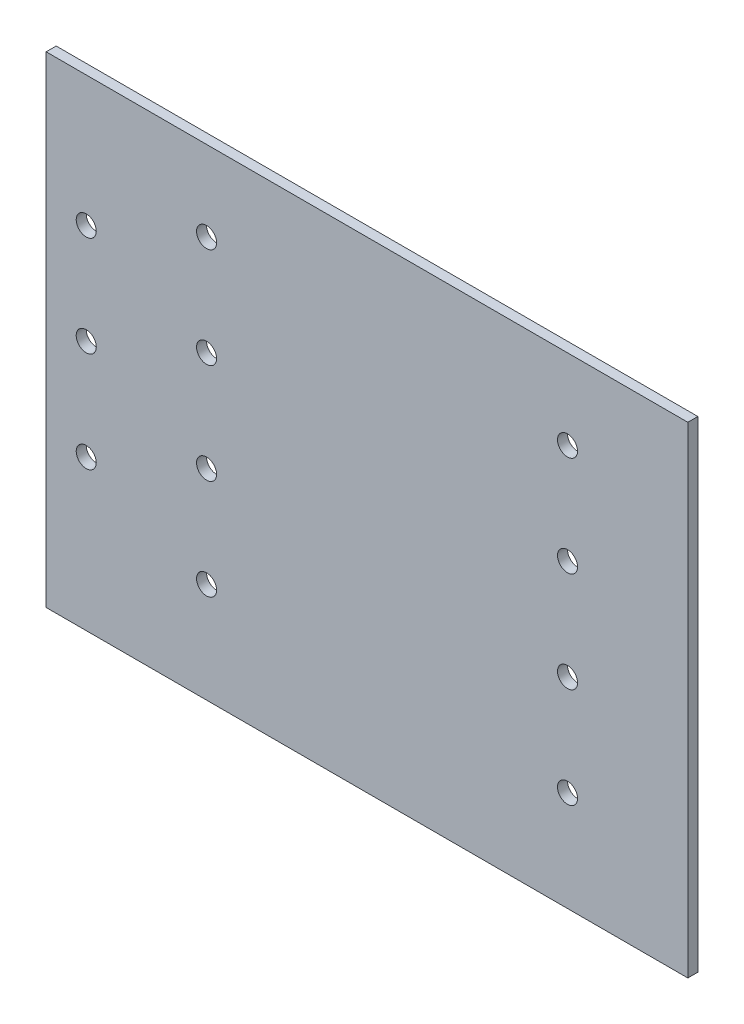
ISO-10303-21;
HEADER;
FILE_DESCRIPTION(('STEP AP214'),'2;1');
FILE_NAME('part.step','',(''),(''),'','','');
FILE_SCHEMA(('AUTOMOTIVE_DESIGN { 1 0 10303 214 1 1 1 1 }'));
ENDSEC;
DATA;
#1=APPLICATION_CONTEXT('core data for automotive mechanical design processes');
#2=APPLICATION_PROTOCOL_DEFINITION('international standard','automotive_design',2000,#1);
#3=PRODUCT_CONTEXT('',#1,'mechanical');
#4=PRODUCT('Part','Part','',(#3));
#5=PRODUCT_RELATED_PRODUCT_CATEGORY('part','',(#4));
#6=PRODUCT_DEFINITION_FORMATION('','',#4);
#7=PRODUCT_DEFINITION_CONTEXT('part definition',#1,'design');
#8=PRODUCT_DEFINITION('design','',#6,#7);
#9=PRODUCT_DEFINITION_SHAPE('','',#8);
#10=(LENGTH_UNIT() NAMED_UNIT(*) SI_UNIT(.MILLI.,.METRE.));
#11=(NAMED_UNIT(*) PLANE_ANGLE_UNIT() SI_UNIT($,.RADIAN.));
#12=(NAMED_UNIT(*) SI_UNIT($,.STERADIAN.) SOLID_ANGLE_UNIT());
#13=UNCERTAINTY_MEASURE_WITH_UNIT(LENGTH_MEASURE(1.E-05),#10,'distance_accuracy_value','');
#14=(GEOMETRIC_REPRESENTATION_CONTEXT(3) GLOBAL_UNCERTAINTY_ASSIGNED_CONTEXT((#13)) GLOBAL_UNIT_ASSIGNED_CONTEXT((#10,
#11,#12)) REPRESENTATION_CONTEXT('',''));
#15=CARTESIAN_POINT('',(0.,0.,0.));
#16=DIRECTION('',(0.,0.,1.));
#17=DIRECTION('',(1.,0.,0.));
#18=AXIS2_PLACEMENT_3D('',#15,#16,#17);
#19=CARTESIAN_POINT('',(1625.6,0.,0.));
#20=DIRECTION('',(0.,0.,-1.));
#21=DIRECTION('',(-1.,0.,0.));
#22=AXIS2_PLACEMENT_3D('',#19,#20,#21);
#23=PLANE('',#22);
#24=CARTESIAN_POINT('',(101.6,635.,0.));
#25=DIRECTION('',(0.,0.,1.));
#26=DIRECTION('',(1.,0.,0.));
#27=AXIS2_PLACEMENT_3D('',#24,#25,#26);
#28=CIRCLE('',#27,25.4);
#29=CARTESIAN_POINT('',(127.,635.,0.));
#30=VERTEX_POINT('',#29);
#31=EDGE_CURVE('E346',#30,#30,#28,.T.);
#32=ORIENTED_EDGE('',*,*,#31,.F.);
#33=EDGE_LOOP('',(#32));
#34=FACE_BOUND('',#33,.T.);
#35=CARTESIAN_POINT('',(101.6,381.,0.));
#36=DIRECTION('',(0.,0.,1.));
#37=DIRECTION('',(1.,0.,0.));
#38=AXIS2_PLACEMENT_3D('',#35,#36,#37);
#39=CIRCLE('',#38,25.4);
#40=CARTESIAN_POINT('',(127.,381.,0.));
#41=VERTEX_POINT('',#40);
#42=EDGE_CURVE('E340',#41,#41,#39,.T.);
#43=ORIENTED_EDGE('',*,*,#42,.F.);
#44=EDGE_LOOP('',(#43));
#45=FACE_BOUND('',#44,.T.);
#46=CARTESIAN_POINT('',(406.4,254.,0.));
#47=DIRECTION('',(0.,0.,1.));
#48=DIRECTION('',(1.,0.,0.));
#49=AXIS2_PLACEMENT_3D('',#46,#47,#48);
#50=CIRCLE('',#49,25.4);
#51=CARTESIAN_POINT('',(431.8,254.,0.));
#52=VERTEX_POINT('',#51);
#53=EDGE_CURVE('E334',#52,#52,#50,.T.);
#54=ORIENTED_EDGE('',*,*,#53,.F.);
#55=EDGE_LOOP('',(#54));
#56=FACE_BOUND('',#55,.T.);
#57=CARTESIAN_POINT('',(1320.8,254.,0.));
#58=DIRECTION('',(0.,0.,1.));
#59=DIRECTION('',(1.,0.,0.));
#60=AXIS2_PLACEMENT_3D('',#57,#58,#59);
#61=CIRCLE('',#60,25.4);
#62=CARTESIAN_POINT('',(1346.2,254.,0.));
#63=VERTEX_POINT('',#62);
#64=EDGE_CURVE('E328',#63,#63,#61,.T.);
#65=ORIENTED_EDGE('',*,*,#64,.F.);
#66=EDGE_LOOP('',(#65));
#67=FACE_BOUND('',#66,.T.);
#68=DIRECTION('',(0.,-1.,0.));
#69=VECTOR('',#68,1.);
#70=CARTESIAN_POINT('',(0.,0.,0.));
#71=LINE('',#70,#69);
#72=CARTESIAN_POINT('',(0.,1219.2,0.));
#73=VERTEX_POINT('',#72);
#74=CARTESIAN_POINT('',(0.,0.,0.));
#75=VERTEX_POINT('',#74);
#76=EDGE_CURVE('E103',#73,#75,#71,.T.);
#77=ORIENTED_EDGE('',*,*,#76,.T.);
#78=DIRECTION('',(-1.,0.,0.));
#79=VECTOR('',#78,1.);
#80=CARTESIAN_POINT('',(1625.6,0.,0.));
#81=LINE('',#80,#79);
#82=CARTESIAN_POINT('',(1625.6,0.,0.));
#83=VERTEX_POINT('',#82);
#84=EDGE_CURVE('E93',#83,#75,#81,.T.);
#85=ORIENTED_EDGE('',*,*,#84,.F.);
#86=DIRECTION('',(0.,-1.,0.));
#87=VECTOR('',#86,1.);
#88=CARTESIAN_POINT('',(1625.6,0.,0.));
#89=LINE('',#88,#87);
#90=CARTESIAN_POINT('',(1625.6,1219.2,0.));
#91=VERTEX_POINT('',#90);
#92=EDGE_CURVE('E87',#91,#83,#89,.T.);
#93=ORIENTED_EDGE('',*,*,#92,.F.);
#94=DIRECTION('',(-1.,0.,0.));
#95=VECTOR('',#94,1.);
#96=CARTESIAN_POINT('',(1625.6,1219.2,0.));
#97=LINE('',#96,#95);
#98=EDGE_CURVE('E99',#91,#73,#97,.T.);
#99=ORIENTED_EDGE('',*,*,#98,.T.);
#100=EDGE_LOOP('',(#77,#85,#93,#99));
#101=FACE_BOUND('',#100,.T.);
#102=CARTESIAN_POINT('',(1320.8,508.,0.));
#103=DIRECTION('',(0.,0.,1.));
#104=DIRECTION('',(1.,0.,0.));
#105=AXIS2_PLACEMENT_3D('',#102,#103,#104);
#106=CIRCLE('',#105,25.4);
#107=CARTESIAN_POINT('',(1346.2,508.,0.));
#108=VERTEX_POINT('',#107);
#109=EDGE_CURVE('E113',#108,#108,#106,.T.);
#110=ORIENTED_EDGE('',*,*,#109,.F.);
#111=EDGE_LOOP('',(#110));
#112=FACE_BOUND('',#111,.T.);
#113=CARTESIAN_POINT('',(406.4,508.,0.));
#114=DIRECTION('',(0.,0.,1.));
#115=DIRECTION('',(1.,0.,0.));
#116=AXIS2_PLACEMENT_3D('',#113,#114,#115);
#117=CIRCLE('',#116,25.4);
#118=CARTESIAN_POINT('',(431.8,508.,0.));
#119=VERTEX_POINT('',#118);
#120=EDGE_CURVE('E119',#119,#119,#117,.T.);
#121=ORIENTED_EDGE('',*,*,#120,.F.);
#122=EDGE_LOOP('',(#121));
#123=FACE_BOUND('',#122,.T.);
#124=CARTESIAN_POINT('',(1320.8,762.,0.));
#125=DIRECTION('',(0.,0.,1.));
#126=DIRECTION('',(1.,0.,0.));
#127=AXIS2_PLACEMENT_3D('',#124,#125,#126);
#128=CIRCLE('',#127,25.4);
#129=CARTESIAN_POINT('',(1346.2,762.,0.));
#130=VERTEX_POINT('',#129);
#131=EDGE_CURVE('E125',#130,#130,#128,.T.);
#132=ORIENTED_EDGE('',*,*,#131,.F.);
#133=EDGE_LOOP('',(#132));
#134=FACE_BOUND('',#133,.T.);
#135=CARTESIAN_POINT('',(406.4,762.,0.));
#136=DIRECTION('',(0.,0.,1.));
#137=DIRECTION('',(1.,0.,0.));
#138=AXIS2_PLACEMENT_3D('',#135,#136,#137);
#139=CIRCLE('',#138,25.4);
#140=CARTESIAN_POINT('',(431.8,762.,0.));
#141=VERTEX_POINT('',#140);
#142=EDGE_CURVE('E131',#141,#141,#139,.T.);
#143=ORIENTED_EDGE('',*,*,#142,.F.);
#144=EDGE_LOOP('',(#143));
#145=FACE_BOUND('',#144,.T.);
#146=CARTESIAN_POINT('',(1320.8,1016.,0.));
#147=DIRECTION('',(0.,0.,1.));
#148=DIRECTION('',(1.,0.,0.));
#149=AXIS2_PLACEMENT_3D('',#146,#147,#148);
#150=CIRCLE('',#149,25.4);
#151=CARTESIAN_POINT('',(1346.2,1016.,0.));
#152=VERTEX_POINT('',#151);
#153=EDGE_CURVE('E137',#152,#152,#150,.T.);
#154=ORIENTED_EDGE('',*,*,#153,.F.);
#155=EDGE_LOOP('',(#154));
#156=FACE_BOUND('',#155,.T.);
#157=CARTESIAN_POINT('',(406.4,1016.,0.));
#158=DIRECTION('',(0.,0.,1.));
#159=DIRECTION('',(1.,0.,0.));
#160=AXIS2_PLACEMENT_3D('',#157,#158,#159);
#161=CIRCLE('',#160,25.4);
#162=CARTESIAN_POINT('',(431.8,1016.,0.));
#163=VERTEX_POINT('',#162);
#164=EDGE_CURVE('E143',#163,#163,#161,.T.);
#165=ORIENTED_EDGE('',*,*,#164,.F.);
#166=EDGE_LOOP('',(#165));
#167=FACE_BOUND('',#166,.T.);
#168=CARTESIAN_POINT('',(101.6,889.,0.));
#169=DIRECTION('',(0.,0.,1.));
#170=DIRECTION('',(1.,0.,0.));
#171=AXIS2_PLACEMENT_3D('',#168,#169,#170);
#172=CIRCLE('',#171,25.4);
#173=CARTESIAN_POINT('',(127.,889.,0.));
#174=VERTEX_POINT('',#173);
#175=EDGE_CURVE('E43',#174,#174,#172,.T.);
#176=ORIENTED_EDGE('',*,*,#175,.F.);
#177=EDGE_LOOP('',(#176));
#178=FACE_BOUND('',#177,.T.);
#179=ADVANCED_FACE('F34',(#34,#45,#56,#67,#101,#112,#123,#134,#145,#156,#167,#178),#23,.F.);
#180=CARTESIAN_POINT('',(1625.6,0.,0.));
#181=DIRECTION('',(0.,1.,0.));
#182=DIRECTION('',(0.,0.,1.));
#183=AXIS2_PLACEMENT_3D('',#180,#181,#182);
#184=PLANE('',#183);
#185=DIRECTION('',(0.,0.,-1.));
#186=VECTOR('',#185,1.);
#187=CARTESIAN_POINT('',(0.,0.,0.));
#188=LINE('',#187,#186);
#189=CARTESIAN_POINT('',(0.,0.,-25.4));
#190=VERTEX_POINT('',#189);
#191=EDGE_CURVE('E92',#75,#190,#188,.T.);
#192=ORIENTED_EDGE('',*,*,#191,.T.);
#193=DIRECTION('',(-1.,0.,0.));
#194=VECTOR('',#193,1.);
#195=CARTESIAN_POINT('',(1625.6,0.,-25.4));
#196=LINE('',#195,#194);
#197=CARTESIAN_POINT('',(1625.6,0.,-25.4));
#198=VERTEX_POINT('',#197);
#199=EDGE_CURVE('E90',#198,#190,#196,.T.);
#200=ORIENTED_EDGE('',*,*,#199,.F.);
#201=DIRECTION('',(0.,0.,-1.));
#202=VECTOR('',#201,1.);
#203=CARTESIAN_POINT('',(1625.6,0.,0.));
#204=LINE('',#203,#202);
#205=EDGE_CURVE('E82',#83,#198,#204,.T.);
#206=ORIENTED_EDGE('',*,*,#205,.F.);
#207=ORIENTED_EDGE('',*,*,#84,.T.);
#208=EDGE_LOOP('',(#192,#200,#206,#207));
#209=FACE_BOUND('',#208,.T.);
#210=ADVANCED_FACE('F91',(#209),#184,.F.);
#211=CARTESIAN_POINT('',(1625.6,0.,-25.4));
#212=DIRECTION('',(0.,0.,1.));
#213=DIRECTION('',(1.,0.,0.));
#214=AXIS2_PLACEMENT_3D('',#211,#212,#213);
#215=PLANE('',#214);
#216=CARTESIAN_POINT('',(101.6,635.,-25.4));
#217=DIRECTION('',(0.,0.,1.));
#218=DIRECTION('',(1.,0.,0.));
#219=AXIS2_PLACEMENT_3D('',#216,#217,#218);
#220=CIRCLE('',#219,25.4);
#221=CARTESIAN_POINT('',(127.,635.,-25.4));
#222=VERTEX_POINT('',#221);
#223=EDGE_CURVE('E343',#222,#222,#220,.F.);
#224=ORIENTED_EDGE('',*,*,#223,.F.);
#225=EDGE_LOOP('',(#224));
#226=FACE_BOUND('',#225,.T.);
#227=CARTESIAN_POINT('',(101.6,381.,-25.4));
#228=DIRECTION('',(0.,0.,1.));
#229=DIRECTION('',(1.,0.,0.));
#230=AXIS2_PLACEMENT_3D('',#227,#228,#229);
#231=CIRCLE('',#230,25.4);
#232=CARTESIAN_POINT('',(127.,381.,-25.4));
#233=VERTEX_POINT('',#232);
#234=EDGE_CURVE('E337',#233,#233,#231,.F.);
#235=ORIENTED_EDGE('',*,*,#234,.F.);
#236=EDGE_LOOP('',(#235));
#237=FACE_BOUND('',#236,.T.);
#238=CARTESIAN_POINT('',(406.4,254.,-25.4));
#239=DIRECTION('',(0.,0.,1.));
#240=DIRECTION('',(1.,0.,0.));
#241=AXIS2_PLACEMENT_3D('',#238,#239,#240);
#242=CIRCLE('',#241,25.4);
#243=CARTESIAN_POINT('',(431.8,254.,-25.4));
#244=VERTEX_POINT('',#243);
#245=EDGE_CURVE('E331',#244,#244,#242,.F.);
#246=ORIENTED_EDGE('',*,*,#245,.F.);
#247=EDGE_LOOP('',(#246));
#248=FACE_BOUND('',#247,.T.);
#249=CARTESIAN_POINT('',(1320.8,254.,-25.4));
#250=DIRECTION('',(0.,0.,1.));
#251=DIRECTION('',(1.,0.,0.));
#252=AXIS2_PLACEMENT_3D('',#249,#250,#251);
#253=CIRCLE('',#252,25.4);
#254=CARTESIAN_POINT('',(1346.2,254.,-25.4));
#255=VERTEX_POINT('',#254);
#256=EDGE_CURVE('E106',#255,#255,#253,.F.);
#257=ORIENTED_EDGE('',*,*,#256,.F.);
#258=EDGE_LOOP('',(#257));
#259=FACE_BOUND('',#258,.T.);
#260=DIRECTION('',(0.,1.,0.));
#261=VECTOR('',#260,1.);
#262=CARTESIAN_POINT('',(0.,0.,-25.4));
#263=LINE('',#262,#261);
#264=CARTESIAN_POINT('',(0.,1219.2,-25.4));
#265=VERTEX_POINT('',#264);
#266=EDGE_CURVE('E68',#190,#265,#263,.T.);
#267=ORIENTED_EDGE('',*,*,#266,.T.);
#268=DIRECTION('',(-1.,0.,0.));
#269=VECTOR('',#268,1.);
#270=CARTESIAN_POINT('',(1625.6,1219.2,-25.4));
#271=LINE('',#270,#269);
#272=CARTESIAN_POINT('',(1625.6,1219.2,-25.4));
#273=VERTEX_POINT('',#272);
#274=EDGE_CURVE('E94',#273,#265,#271,.T.);
#275=ORIENTED_EDGE('',*,*,#274,.F.);
#276=DIRECTION('',(0.,1.,0.));
#277=VECTOR('',#276,1.);
#278=CARTESIAN_POINT('',(1625.6,0.,-25.4));
#279=LINE('',#278,#277);
#280=EDGE_CURVE('E85',#198,#273,#279,.T.);
#281=ORIENTED_EDGE('',*,*,#280,.F.);
#282=ORIENTED_EDGE('',*,*,#199,.T.);
#283=EDGE_LOOP('',(#267,#275,#281,#282));
#284=FACE_BOUND('',#283,.T.);
#285=CARTESIAN_POINT('',(1320.8,508.,-25.4));
#286=DIRECTION('',(0.,0.,1.));
#287=DIRECTION('',(1.,0.,0.));
#288=AXIS2_PLACEMENT_3D('',#285,#286,#287);
#289=CIRCLE('',#288,25.4);
#290=CARTESIAN_POINT('',(1346.2,508.,-25.4));
#291=VERTEX_POINT('',#290);
#292=EDGE_CURVE('E116',#291,#291,#289,.F.);
#293=ORIENTED_EDGE('',*,*,#292,.F.);
#294=EDGE_LOOP('',(#293));
#295=FACE_BOUND('',#294,.T.);
#296=CARTESIAN_POINT('',(406.4,508.,-25.4));
#297=DIRECTION('',(0.,0.,1.));
#298=DIRECTION('',(1.,0.,0.));
#299=AXIS2_PLACEMENT_3D('',#296,#297,#298);
#300=CIRCLE('',#299,25.4);
#301=CARTESIAN_POINT('',(431.8,508.,-25.4));
#302=VERTEX_POINT('',#301);
#303=EDGE_CURVE('E122',#302,#302,#300,.F.);
#304=ORIENTED_EDGE('',*,*,#303,.F.);
#305=EDGE_LOOP('',(#304));
#306=FACE_BOUND('',#305,.T.);
#307=CARTESIAN_POINT('',(1320.8,762.,-25.4));
#308=DIRECTION('',(0.,0.,1.));
#309=DIRECTION('',(1.,0.,0.));
#310=AXIS2_PLACEMENT_3D('',#307,#308,#309);
#311=CIRCLE('',#310,25.4);
#312=CARTESIAN_POINT('',(1346.2,762.,-25.4));
#313=VERTEX_POINT('',#312);
#314=EDGE_CURVE('E128',#313,#313,#311,.F.);
#315=ORIENTED_EDGE('',*,*,#314,.F.);
#316=EDGE_LOOP('',(#315));
#317=FACE_BOUND('',#316,.T.);
#318=CARTESIAN_POINT('',(406.4,762.,-25.4));
#319=DIRECTION('',(0.,0.,1.));
#320=DIRECTION('',(1.,0.,0.));
#321=AXIS2_PLACEMENT_3D('',#318,#319,#320);
#322=CIRCLE('',#321,25.4);
#323=CARTESIAN_POINT('',(431.8,762.,-25.4));
#324=VERTEX_POINT('',#323);
#325=EDGE_CURVE('E134',#324,#324,#322,.F.);
#326=ORIENTED_EDGE('',*,*,#325,.F.);
#327=EDGE_LOOP('',(#326));
#328=FACE_BOUND('',#327,.T.);
#329=CARTESIAN_POINT('',(1320.8,1016.,-25.4));
#330=DIRECTION('',(0.,0.,1.));
#331=DIRECTION('',(1.,0.,0.));
#332=AXIS2_PLACEMENT_3D('',#329,#330,#331);
#333=CIRCLE('',#332,25.4);
#334=CARTESIAN_POINT('',(1346.2,1016.,-25.4));
#335=VERTEX_POINT('',#334);
#336=EDGE_CURVE('E140',#335,#335,#333,.F.);
#337=ORIENTED_EDGE('',*,*,#336,.F.);
#338=EDGE_LOOP('',(#337));
#339=FACE_BOUND('',#338,.T.);
#340=CARTESIAN_POINT('',(406.4,1016.,-25.4));
#341=DIRECTION('',(0.,0.,1.));
#342=DIRECTION('',(1.,0.,0.));
#343=AXIS2_PLACEMENT_3D('',#340,#341,#342);
#344=CIRCLE('',#343,25.4);
#345=CARTESIAN_POINT('',(431.8,1016.,-25.4));
#346=VERTEX_POINT('',#345);
#347=EDGE_CURVE('E146',#346,#346,#344,.F.);
#348=ORIENTED_EDGE('',*,*,#347,.F.);
#349=EDGE_LOOP('',(#348));
#350=FACE_BOUND('',#349,.T.);
#351=CARTESIAN_POINT('',(101.6,889.,-25.4));
#352=DIRECTION('',(0.,0.,1.));
#353=DIRECTION('',(1.,0.,0.));
#354=AXIS2_PLACEMENT_3D('',#351,#352,#353);
#355=CIRCLE('',#354,25.4);
#356=CARTESIAN_POINT('',(127.,889.,-25.4));
#357=VERTEX_POINT('',#356);
#358=EDGE_CURVE('E11',#357,#357,#355,.F.);
#359=ORIENTED_EDGE('',*,*,#358,.F.);
#360=EDGE_LOOP('',(#359));
#361=FACE_BOUND('',#360,.T.);
#362=ADVANCED_FACE('F96',(#226,#237,#248,#259,#284,#295,#306,#317,#328,#339,#350,#361),#215,.F.);
#363=CARTESIAN_POINT('',(1625.6,1219.2,0.));
#364=DIRECTION('',(0.,-1.,0.));
#365=DIRECTION('',(0.,0.,-1.));
#366=AXIS2_PLACEMENT_3D('',#363,#364,#365);
#367=PLANE('',#366);
#368=DIRECTION('',(0.,0.,1.));
#369=VECTOR('',#368,1.);
#370=CARTESIAN_POINT('',(0.,1219.2,0.));
#371=LINE('',#370,#369);
#372=EDGE_CURVE('E74',#265,#73,#371,.T.);
#373=ORIENTED_EDGE('',*,*,#372,.T.);
#374=ORIENTED_EDGE('',*,*,#98,.F.);
#375=DIRECTION('',(0.,0.,1.));
#376=VECTOR('',#375,1.);
#377=CARTESIAN_POINT('',(1625.6,1219.2,0.));
#378=LINE('',#377,#376);
#379=EDGE_CURVE('E51',#273,#91,#378,.T.);
#380=ORIENTED_EDGE('',*,*,#379,.F.);
#381=ORIENTED_EDGE('',*,*,#274,.T.);
#382=EDGE_LOOP('',(#373,#374,#380,#381));
#383=FACE_BOUND('',#382,.T.);
#384=ADVANCED_FACE('F200',(#383),#367,.F.);
#385=CARTESIAN_POINT('',(1625.6,0.,0.));
#386=DIRECTION('',(-1.,0.,0.));
#387=DIRECTION('',(0.,0.,1.));
#388=AXIS2_PLACEMENT_3D('',#385,#386,#387);
#389=PLANE('',#388);
#390=ORIENTED_EDGE('',*,*,#92,.T.);
#391=ORIENTED_EDGE('',*,*,#205,.T.);
#392=ORIENTED_EDGE('',*,*,#280,.T.);
#393=ORIENTED_EDGE('',*,*,#379,.T.);
#394=EDGE_LOOP('',(#390,#391,#392,#393));
#395=FACE_BOUND('',#394,.T.);
#396=ADVANCED_FACE('F83',(#395),#389,.F.);
#397=CARTESIAN_POINT('',(0.,0.,0.));
#398=DIRECTION('',(-1.,0.,0.));
#399=DIRECTION('',(0.,0.,1.));
#400=AXIS2_PLACEMENT_3D('',#397,#398,#399);
#401=PLANE('',#400);
#402=ORIENTED_EDGE('',*,*,#76,.F.);
#403=ORIENTED_EDGE('',*,*,#372,.F.);
#404=ORIENTED_EDGE('',*,*,#266,.F.);
#405=ORIENTED_EDGE('',*,*,#191,.F.);
#406=EDGE_LOOP('',(#402,#403,#404,#405));
#407=FACE_BOUND('',#406,.T.);
#408=ADVANCED_FACE('F220',(#407),#401,.T.);
#409=CARTESIAN_POINT('',(1320.8,254.,-25.401));
#410=DIRECTION('',(0.,0.,1.));
#411=DIRECTION('',(1.,0.,0.));
#412=AXIS2_PLACEMENT_3D('',#409,#410,#411);
#413=CYLINDRICAL_SURFACE('',#412,25.4);
#414=CARTESIAN_POINT('',(1346.2,254.,0.));
#415=CARTESIAN_POINT('',(1346.2,254.,-0.264583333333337));
#416=CARTESIAN_POINT('',(1346.2,254.,-0.52916666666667));
#417=CARTESIAN_POINT('',(1346.2,254.,-1.05833333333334));
#418=CARTESIAN_POINT('',(1346.2,254.,-1.32291666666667));
#419=CARTESIAN_POINT('',(1346.2,254.,-1.85208333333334));
#420=CARTESIAN_POINT('',(1346.2,254.,-2.11666666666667));
#421=CARTESIAN_POINT('',(1346.2,254.,-2.64583333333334));
#422=CARTESIAN_POINT('',(1346.2,254.,-2.91041666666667));
#423=CARTESIAN_POINT('',(1346.2,254.,-3.43958333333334));
#424=CARTESIAN_POINT('',(1346.2,254.,-3.70416666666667));
#425=CARTESIAN_POINT('',(1346.2,254.,-4.23333333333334));
#426=CARTESIAN_POINT('',(1346.2,254.,-4.49791666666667));
#427=CARTESIAN_POINT('',(1346.2,254.,-5.02708333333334));
#428=CARTESIAN_POINT('',(1346.2,254.,-5.29166666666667));
#429=CARTESIAN_POINT('',(1346.2,254.,-5.82083333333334));
#430=CARTESIAN_POINT('',(1346.2,254.,-6.08541666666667));
#431=CARTESIAN_POINT('',(1346.2,254.,-6.61458333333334));
#432=CARTESIAN_POINT('',(1346.2,254.,-6.87916666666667));
#433=CARTESIAN_POINT('',(1346.2,254.,-7.40833333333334));
#434=CARTESIAN_POINT('',(1346.2,254.,-7.67291666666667));
#435=CARTESIAN_POINT('',(1346.2,254.,-8.20208333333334));
#436=CARTESIAN_POINT('',(1346.2,254.,-8.46666666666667));
#437=CARTESIAN_POINT('',(1346.2,254.,-8.99583333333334));
#438=CARTESIAN_POINT('',(1346.2,254.,-9.26041666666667));
#439=CARTESIAN_POINT('',(1346.2,254.,-9.78958333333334));
#440=CARTESIAN_POINT('',(1346.2,254.,-10.0541666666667));
#441=CARTESIAN_POINT('',(1346.2,254.,-10.5833333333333));
#442=CARTESIAN_POINT('',(1346.2,254.,-10.8479166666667));
#443=CARTESIAN_POINT('',(1346.2,254.,-11.3770833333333));
#444=CARTESIAN_POINT('',(1346.2,254.,-11.6416666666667));
#445=CARTESIAN_POINT('',(1346.2,254.,-12.1708333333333));
#446=CARTESIAN_POINT('',(1346.2,254.,-12.4354166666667));
#447=CARTESIAN_POINT('',(1346.2,254.,-12.9645833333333));
#448=CARTESIAN_POINT('',(1346.2,254.,-13.2291666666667));
#449=CARTESIAN_POINT('',(1346.2,254.,-13.7583333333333));
#450=CARTESIAN_POINT('',(1346.2,254.,-14.0229166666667));
#451=CARTESIAN_POINT('',(1346.2,254.,-14.5520833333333));
#452=CARTESIAN_POINT('',(1346.2,254.,-14.8166666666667));
#453=CARTESIAN_POINT('',(1346.2,254.,-15.3458333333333));
#454=CARTESIAN_POINT('',(1346.2,254.,-15.6104166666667));
#455=CARTESIAN_POINT('',(1346.2,254.,-16.1395833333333));
#456=CARTESIAN_POINT('',(1346.2,254.,-16.4041666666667));
#457=CARTESIAN_POINT('',(1346.2,254.,-16.9333333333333));
#458=CARTESIAN_POINT('',(1346.2,254.,-17.1979166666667));
#459=CARTESIAN_POINT('',(1346.2,254.,-17.7270833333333));
#460=CARTESIAN_POINT('',(1346.2,254.,-17.9916666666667));
#461=CARTESIAN_POINT('',(1346.2,254.,-18.5208333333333));
#462=CARTESIAN_POINT('',(1346.2,254.,-18.7854166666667));
#463=CARTESIAN_POINT('',(1346.2,254.,-19.3145833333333));
#464=CARTESIAN_POINT('',(1346.2,254.,-19.5791666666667));
#465=CARTESIAN_POINT('',(1346.2,254.,-20.1083333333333));
#466=CARTESIAN_POINT('',(1346.2,254.,-20.3729166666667));
#467=CARTESIAN_POINT('',(1346.2,254.,-20.9020833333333));
#468=CARTESIAN_POINT('',(1346.2,254.,-21.1666666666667));
#469=CARTESIAN_POINT('',(1346.2,254.,-21.6958333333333));
#470=CARTESIAN_POINT('',(1346.2,254.,-21.9604166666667));
#471=CARTESIAN_POINT('',(1346.2,254.,-22.4895833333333));
#472=CARTESIAN_POINT('',(1346.2,254.,-22.7541666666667));
#473=CARTESIAN_POINT('',(1346.2,254.,-23.2833333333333));
#474=CARTESIAN_POINT('',(1346.2,254.,-23.5479166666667));
#475=CARTESIAN_POINT('',(1346.2,254.,-24.0770833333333));
#476=CARTESIAN_POINT('',(1346.2,254.,-24.3416666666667));
#477=CARTESIAN_POINT('',(1346.2,254.,-24.8708333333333));
#478=CARTESIAN_POINT('',(1346.2,254.,-25.1354166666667));
#479=CARTESIAN_POINT('',(1346.2,254.,-25.4));
#480=B_SPLINE_CURVE_WITH_KNOTS('',3,(#414,#415,#416,#417,#418,#419,#420,#421,#422,#423,#424,
#425,#426,#427,#428,#429,#430,#431,#432,#433,#434,#435,#436,#437,#438,#439,#440,#441,#442,#443,
#444,#445,#446,#447,#448,#449,#450,#451,#452,#453,#454,#455,#456,#457,#458,#459,#460,#461,#462,
#463,#464,#465,#466,#467,#468,#469,#470,#471,#472,#473,#474,#475,#476,#477,#478,#479),
.UNSPECIFIED.,.F.,.F.,(4,2,2,2,2,2,2,2,2,2,2,2,2,2,2,2,2,2,2,2,2,2,2,2,2,2,2,2,2,2,2,2,4),(0.,
0.793749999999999,1.5875,2.38125,3.175,3.96875,4.7625,5.55625,6.35,7.14375,7.9375,8.73125,9.525,
10.31875,11.1125,11.90625,12.7,13.49375,14.2875,15.08125,15.875,16.66875,17.4625,18.25625,19.05,
19.84375,20.6375,21.43125,22.225,23.01875,23.8125,24.60625,25.4),.UNSPECIFIED.);
#481=EDGE_CURVE('BSEAM216',#63,#255,#480,.T.);
#482=ORIENTED_EDGE('',*,*,#64,.T.);
#483=ORIENTED_EDGE('',*,*,#256,.T.);
#484=ORIENTED_EDGE('',*,*,#481,.T.);
#485=ORIENTED_EDGE('',*,*,#481,.F.);
#486=EDGE_LOOP('',(#482,#484,#483,#485));
#487=FACE_BOUND('',#486,.T.);
#488=ADVANCED_FACE('F216',(#487),#413,.F.);
#489=CARTESIAN_POINT('',(406.4,254.,-25.401));
#490=DIRECTION('',(0.,0.,1.));
#491=DIRECTION('',(1.,0.,0.));
#492=AXIS2_PLACEMENT_3D('',#489,#490,#491);
#493=CYLINDRICAL_SURFACE('',#492,25.4);
#494=CARTESIAN_POINT('',(431.8,254.,0.));
#495=CARTESIAN_POINT('',(431.8,254.,-0.264583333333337));
#496=CARTESIAN_POINT('',(431.8,254.,-0.52916666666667));
#497=CARTESIAN_POINT('',(431.8,254.,-1.05833333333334));
#498=CARTESIAN_POINT('',(431.8,254.,-1.32291666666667));
#499=CARTESIAN_POINT('',(431.8,254.,-1.85208333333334));
#500=CARTESIAN_POINT('',(431.8,254.,-2.11666666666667));
#501=CARTESIAN_POINT('',(431.8,254.,-2.64583333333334));
#502=CARTESIAN_POINT('',(431.8,254.,-2.91041666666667));
#503=CARTESIAN_POINT('',(431.8,254.,-3.43958333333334));
#504=CARTESIAN_POINT('',(431.8,254.,-3.70416666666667));
#505=CARTESIAN_POINT('',(431.8,254.,-4.23333333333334));
#506=CARTESIAN_POINT('',(431.8,254.,-4.49791666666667));
#507=CARTESIAN_POINT('',(431.8,254.,-5.02708333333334));
#508=CARTESIAN_POINT('',(431.8,254.,-5.29166666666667));
#509=CARTESIAN_POINT('',(431.8,254.,-5.82083333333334));
#510=CARTESIAN_POINT('',(431.8,254.,-6.08541666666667));
#511=CARTESIAN_POINT('',(431.8,254.,-6.61458333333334));
#512=CARTESIAN_POINT('',(431.8,254.,-6.87916666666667));
#513=CARTESIAN_POINT('',(431.8,254.,-7.40833333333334));
#514=CARTESIAN_POINT('',(431.8,254.,-7.67291666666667));
#515=CARTESIAN_POINT('',(431.8,254.,-8.20208333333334));
#516=CARTESIAN_POINT('',(431.8,254.,-8.46666666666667));
#517=CARTESIAN_POINT('',(431.8,254.,-8.99583333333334));
#518=CARTESIAN_POINT('',(431.8,254.,-9.26041666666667));
#519=CARTESIAN_POINT('',(431.8,254.,-9.78958333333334));
#520=CARTESIAN_POINT('',(431.8,254.,-10.0541666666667));
#521=CARTESIAN_POINT('',(431.8,254.,-10.5833333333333));
#522=CARTESIAN_POINT('',(431.8,254.,-10.8479166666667));
#523=CARTESIAN_POINT('',(431.8,254.,-11.3770833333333));
#524=CARTESIAN_POINT('',(431.8,254.,-11.6416666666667));
#525=CARTESIAN_POINT('',(431.8,254.,-12.1708333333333));
#526=CARTESIAN_POINT('',(431.8,254.,-12.4354166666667));
#527=CARTESIAN_POINT('',(431.8,254.,-12.9645833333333));
#528=CARTESIAN_POINT('',(431.8,254.,-13.2291666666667));
#529=CARTESIAN_POINT('',(431.8,254.,-13.7583333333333));
#530=CARTESIAN_POINT('',(431.8,254.,-14.0229166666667));
#531=CARTESIAN_POINT('',(431.8,254.,-14.5520833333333));
#532=CARTESIAN_POINT('',(431.8,254.,-14.8166666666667));
#533=CARTESIAN_POINT('',(431.8,254.,-15.3458333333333));
#534=CARTESIAN_POINT('',(431.8,254.,-15.6104166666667));
#535=CARTESIAN_POINT('',(431.8,254.,-16.1395833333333));
#536=CARTESIAN_POINT('',(431.8,254.,-16.4041666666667));
#537=CARTESIAN_POINT('',(431.8,254.,-16.9333333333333));
#538=CARTESIAN_POINT('',(431.8,254.,-17.1979166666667));
#539=CARTESIAN_POINT('',(431.8,254.,-17.7270833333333));
#540=CARTESIAN_POINT('',(431.8,254.,-17.9916666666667));
#541=CARTESIAN_POINT('',(431.8,254.,-18.5208333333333));
#542=CARTESIAN_POINT('',(431.8,254.,-18.7854166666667));
#543=CARTESIAN_POINT('',(431.8,254.,-19.3145833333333));
#544=CARTESIAN_POINT('',(431.8,254.,-19.5791666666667));
#545=CARTESIAN_POINT('',(431.8,254.,-20.1083333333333));
#546=CARTESIAN_POINT('',(431.8,254.,-20.3729166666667));
#547=CARTESIAN_POINT('',(431.8,254.,-20.9020833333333));
#548=CARTESIAN_POINT('',(431.8,254.,-21.1666666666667));
#549=CARTESIAN_POINT('',(431.8,254.,-21.6958333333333));
#550=CARTESIAN_POINT('',(431.8,254.,-21.9604166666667));
#551=CARTESIAN_POINT('',(431.8,254.,-22.4895833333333));
#552=CARTESIAN_POINT('',(431.8,254.,-22.7541666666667));
#553=CARTESIAN_POINT('',(431.8,254.,-23.2833333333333));
#554=CARTESIAN_POINT('',(431.8,254.,-23.5479166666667));
#555=CARTESIAN_POINT('',(431.8,254.,-24.0770833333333));
#556=CARTESIAN_POINT('',(431.8,254.,-24.3416666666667));
#557=CARTESIAN_POINT('',(431.8,254.,-24.8708333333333));
#558=CARTESIAN_POINT('',(431.8,254.,-25.1354166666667));
#559=CARTESIAN_POINT('',(431.8,254.,-25.4));
#560=B_SPLINE_CURVE_WITH_KNOTS('',3,(#494,#495,#496,#497,#498,#499,#500,#501,#502,#503,#504,
#505,#506,#507,#508,#509,#510,#511,#512,#513,#514,#515,#516,#517,#518,#519,#520,#521,#522,#523,
#524,#525,#526,#527,#528,#529,#530,#531,#532,#533,#534,#535,#536,#537,#538,#539,#540,#541,#542,
#543,#544,#545,#546,#547,#548,#549,#550,#551,#552,#553,#554,#555,#556,#557,#558,#559),
.UNSPECIFIED.,.F.,.F.,(4,2,2,2,2,2,2,2,2,2,2,2,2,2,2,2,2,2,2,2,2,2,2,2,2,2,2,2,2,2,2,2,4),(0.,
0.793749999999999,1.5875,2.38125,3.175,3.96875,4.7625,5.55625,6.35,7.14375,7.9375,8.73125,9.525,
10.31875,11.1125,11.90625,12.7,13.49375,14.2875,15.08125,15.875,16.66875,17.4625,18.25625,19.05,
19.84375,20.6375,21.43125,22.225,23.01875,23.8125,24.60625,25.4),.UNSPECIFIED.);
#561=EDGE_CURVE('BSEAM168',#52,#244,#560,.T.);
#562=ORIENTED_EDGE('',*,*,#53,.T.);
#563=ORIENTED_EDGE('',*,*,#245,.T.);
#564=ORIENTED_EDGE('',*,*,#561,.T.);
#565=ORIENTED_EDGE('',*,*,#561,.F.);
#566=EDGE_LOOP('',(#562,#564,#563,#565));
#567=FACE_BOUND('',#566,.T.);
#568=ADVANCED_FACE('F168',(#567),#493,.F.);
#569=CARTESIAN_POINT('',(1320.8,508.,-25.401));
#570=DIRECTION('',(0.,0.,1.));
#571=DIRECTION('',(1.,0.,0.));
#572=AXIS2_PLACEMENT_3D('',#569,#570,#571);
#573=CYLINDRICAL_SURFACE('',#572,25.4);
#574=CARTESIAN_POINT('',(1346.2,508.,0.));
#575=CARTESIAN_POINT('',(1346.2,508.,-0.264583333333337));
#576=CARTESIAN_POINT('',(1346.2,508.,-0.52916666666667));
#577=CARTESIAN_POINT('',(1346.2,508.,-1.05833333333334));
#578=CARTESIAN_POINT('',(1346.2,508.,-1.32291666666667));
#579=CARTESIAN_POINT('',(1346.2,508.,-1.85208333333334));
#580=CARTESIAN_POINT('',(1346.2,508.,-2.11666666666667));
#581=CARTESIAN_POINT('',(1346.2,508.,-2.64583333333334));
#582=CARTESIAN_POINT('',(1346.2,508.,-2.91041666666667));
#583=CARTESIAN_POINT('',(1346.2,508.,-3.43958333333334));
#584=CARTESIAN_POINT('',(1346.2,508.,-3.70416666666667));
#585=CARTESIAN_POINT('',(1346.2,508.,-4.23333333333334));
#586=CARTESIAN_POINT('',(1346.2,508.,-4.49791666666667));
#587=CARTESIAN_POINT('',(1346.2,508.,-5.02708333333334));
#588=CARTESIAN_POINT('',(1346.2,508.,-5.29166666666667));
#589=CARTESIAN_POINT('',(1346.2,508.,-5.82083333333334));
#590=CARTESIAN_POINT('',(1346.2,508.,-6.08541666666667));
#591=CARTESIAN_POINT('',(1346.2,508.,-6.61458333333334));
#592=CARTESIAN_POINT('',(1346.2,508.,-6.87916666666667));
#593=CARTESIAN_POINT('',(1346.2,508.,-7.40833333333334));
#594=CARTESIAN_POINT('',(1346.2,508.,-7.67291666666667));
#595=CARTESIAN_POINT('',(1346.2,508.,-8.20208333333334));
#596=CARTESIAN_POINT('',(1346.2,508.,-8.46666666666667));
#597=CARTESIAN_POINT('',(1346.2,508.,-8.99583333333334));
#598=CARTESIAN_POINT('',(1346.2,508.,-9.26041666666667));
#599=CARTESIAN_POINT('',(1346.2,508.,-9.78958333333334));
#600=CARTESIAN_POINT('',(1346.2,508.,-10.0541666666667));
#601=CARTESIAN_POINT('',(1346.2,508.,-10.5833333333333));
#602=CARTESIAN_POINT('',(1346.2,508.,-10.8479166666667));
#603=CARTESIAN_POINT('',(1346.2,508.,-11.3770833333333));
#604=CARTESIAN_POINT('',(1346.2,508.,-11.6416666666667));
#605=CARTESIAN_POINT('',(1346.2,508.,-12.1708333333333));
#606=CARTESIAN_POINT('',(1346.2,508.,-12.4354166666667));
#607=CARTESIAN_POINT('',(1346.2,508.,-12.9645833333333));
#608=CARTESIAN_POINT('',(1346.2,508.,-13.2291666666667));
#609=CARTESIAN_POINT('',(1346.2,508.,-13.7583333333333));
#610=CARTESIAN_POINT('',(1346.2,508.,-14.0229166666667));
#611=CARTESIAN_POINT('',(1346.2,508.,-14.5520833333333));
#612=CARTESIAN_POINT('',(1346.2,508.,-14.8166666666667));
#613=CARTESIAN_POINT('',(1346.2,508.,-15.3458333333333));
#614=CARTESIAN_POINT('',(1346.2,508.,-15.6104166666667));
#615=CARTESIAN_POINT('',(1346.2,508.,-16.1395833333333));
#616=CARTESIAN_POINT('',(1346.2,508.,-16.4041666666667));
#617=CARTESIAN_POINT('',(1346.2,508.,-16.9333333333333));
#618=CARTESIAN_POINT('',(1346.2,508.,-17.1979166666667));
#619=CARTESIAN_POINT('',(1346.2,508.,-17.7270833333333));
#620=CARTESIAN_POINT('',(1346.2,508.,-17.9916666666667));
#621=CARTESIAN_POINT('',(1346.2,508.,-18.5208333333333));
#622=CARTESIAN_POINT('',(1346.2,508.,-18.7854166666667));
#623=CARTESIAN_POINT('',(1346.2,508.,-19.3145833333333));
#624=CARTESIAN_POINT('',(1346.2,508.,-19.5791666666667));
#625=CARTESIAN_POINT('',(1346.2,508.,-20.1083333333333));
#626=CARTESIAN_POINT('',(1346.2,508.,-20.3729166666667));
#627=CARTESIAN_POINT('',(1346.2,508.,-20.9020833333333));
#628=CARTESIAN_POINT('',(1346.2,508.,-21.1666666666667));
#629=CARTESIAN_POINT('',(1346.2,508.,-21.6958333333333));
#630=CARTESIAN_POINT('',(1346.2,508.,-21.9604166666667));
#631=CARTESIAN_POINT('',(1346.2,508.,-22.4895833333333));
#632=CARTESIAN_POINT('',(1346.2,508.,-22.7541666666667));
#633=CARTESIAN_POINT('',(1346.2,508.,-23.2833333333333));
#634=CARTESIAN_POINT('',(1346.2,508.,-23.5479166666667));
#635=CARTESIAN_POINT('',(1346.2,508.,-24.0770833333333));
#636=CARTESIAN_POINT('',(1346.2,508.,-24.3416666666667));
#637=CARTESIAN_POINT('',(1346.2,508.,-24.8708333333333));
#638=CARTESIAN_POINT('',(1346.2,508.,-25.1354166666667));
#639=CARTESIAN_POINT('',(1346.2,508.,-25.4));
#640=B_SPLINE_CURVE_WITH_KNOTS('',3,(#574,#575,#576,#577,#578,#579,#580,#581,#582,#583,#584,
#585,#586,#587,#588,#589,#590,#591,#592,#593,#594,#595,#596,#597,#598,#599,#600,#601,#602,#603,
#604,#605,#606,#607,#608,#609,#610,#611,#612,#613,#614,#615,#616,#617,#618,#619,#620,#621,#622,
#623,#624,#625,#626,#627,#628,#629,#630,#631,#632,#633,#634,#635,#636,#637,#638,#639),
.UNSPECIFIED.,.F.,.F.,(4,2,2,2,2,2,2,2,2,2,2,2,2,2,2,2,2,2,2,2,2,2,2,2,2,2,2,2,2,2,2,2,4),(0.,
0.793749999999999,1.5875,2.38125,3.175,3.96875,4.7625,5.55625,6.35,7.14375,7.9375,8.73125,9.525,
10.31875,11.1125,11.90625,12.7,13.49375,14.2875,15.08125,15.875,16.66875,17.4625,18.25625,19.05,
19.84375,20.6375,21.43125,22.225,23.01875,23.8125,24.60625,25.4),.UNSPECIFIED.);
#641=EDGE_CURVE('BSEAM164',#108,#291,#640,.T.);
#642=ORIENTED_EDGE('',*,*,#109,.T.);
#643=ORIENTED_EDGE('',*,*,#292,.T.);
#644=ORIENTED_EDGE('',*,*,#641,.T.);
#645=ORIENTED_EDGE('',*,*,#641,.F.);
#646=EDGE_LOOP('',(#642,#644,#643,#645));
#647=FACE_BOUND('',#646,.T.);
#648=ADVANCED_FACE('F164',(#647),#573,.F.);
#649=CARTESIAN_POINT('',(406.4,508.,-25.401));
#650=DIRECTION('',(0.,0.,1.));
#651=DIRECTION('',(1.,0.,0.));
#652=AXIS2_PLACEMENT_3D('',#649,#650,#651);
#653=CYLINDRICAL_SURFACE('',#652,25.4);
#654=CARTESIAN_POINT('',(431.8,508.,0.));
#655=CARTESIAN_POINT('',(431.8,508.,-0.264583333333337));
#656=CARTESIAN_POINT('',(431.8,508.,-0.52916666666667));
#657=CARTESIAN_POINT('',(431.8,508.,-1.05833333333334));
#658=CARTESIAN_POINT('',(431.8,508.,-1.32291666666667));
#659=CARTESIAN_POINT('',(431.8,508.,-1.85208333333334));
#660=CARTESIAN_POINT('',(431.8,508.,-2.11666666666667));
#661=CARTESIAN_POINT('',(431.8,508.,-2.64583333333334));
#662=CARTESIAN_POINT('',(431.8,508.,-2.91041666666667));
#663=CARTESIAN_POINT('',(431.8,508.,-3.43958333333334));
#664=CARTESIAN_POINT('',(431.8,508.,-3.70416666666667));
#665=CARTESIAN_POINT('',(431.8,508.,-4.23333333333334));
#666=CARTESIAN_POINT('',(431.8,508.,-4.49791666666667));
#667=CARTESIAN_POINT('',(431.8,508.,-5.02708333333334));
#668=CARTESIAN_POINT('',(431.8,508.,-5.29166666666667));
#669=CARTESIAN_POINT('',(431.8,508.,-5.82083333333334));
#670=CARTESIAN_POINT('',(431.8,508.,-6.08541666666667));
#671=CARTESIAN_POINT('',(431.8,508.,-6.61458333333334));
#672=CARTESIAN_POINT('',(431.8,508.,-6.87916666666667));
#673=CARTESIAN_POINT('',(431.8,508.,-7.40833333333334));
#674=CARTESIAN_POINT('',(431.8,508.,-7.67291666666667));
#675=CARTESIAN_POINT('',(431.8,508.,-8.20208333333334));
#676=CARTESIAN_POINT('',(431.8,508.,-8.46666666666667));
#677=CARTESIAN_POINT('',(431.8,508.,-8.99583333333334));
#678=CARTESIAN_POINT('',(431.8,508.,-9.26041666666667));
#679=CARTESIAN_POINT('',(431.8,508.,-9.78958333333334));
#680=CARTESIAN_POINT('',(431.8,508.,-10.0541666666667));
#681=CARTESIAN_POINT('',(431.8,508.,-10.5833333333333));
#682=CARTESIAN_POINT('',(431.8,508.,-10.8479166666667));
#683=CARTESIAN_POINT('',(431.8,508.,-11.3770833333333));
#684=CARTESIAN_POINT('',(431.8,508.,-11.6416666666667));
#685=CARTESIAN_POINT('',(431.8,508.,-12.1708333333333));
#686=CARTESIAN_POINT('',(431.8,508.,-12.4354166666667));
#687=CARTESIAN_POINT('',(431.8,508.,-12.9645833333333));
#688=CARTESIAN_POINT('',(431.8,508.,-13.2291666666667));
#689=CARTESIAN_POINT('',(431.8,508.,-13.7583333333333));
#690=CARTESIAN_POINT('',(431.8,508.,-14.0229166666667));
#691=CARTESIAN_POINT('',(431.8,508.,-14.5520833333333));
#692=CARTESIAN_POINT('',(431.8,508.,-14.8166666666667));
#693=CARTESIAN_POINT('',(431.8,508.,-15.3458333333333));
#694=CARTESIAN_POINT('',(431.8,508.,-15.6104166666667));
#695=CARTESIAN_POINT('',(431.8,508.,-16.1395833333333));
#696=CARTESIAN_POINT('',(431.8,508.,-16.4041666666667));
#697=CARTESIAN_POINT('',(431.8,508.,-16.9333333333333));
#698=CARTESIAN_POINT('',(431.8,508.,-17.1979166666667));
#699=CARTESIAN_POINT('',(431.8,508.,-17.7270833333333));
#700=CARTESIAN_POINT('',(431.8,508.,-17.9916666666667));
#701=CARTESIAN_POINT('',(431.8,508.,-18.5208333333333));
#702=CARTESIAN_POINT('',(431.8,508.,-18.7854166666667));
#703=CARTESIAN_POINT('',(431.8,508.,-19.3145833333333));
#704=CARTESIAN_POINT('',(431.8,508.,-19.5791666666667));
#705=CARTESIAN_POINT('',(431.8,508.,-20.1083333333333));
#706=CARTESIAN_POINT('',(431.8,508.,-20.3729166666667));
#707=CARTESIAN_POINT('',(431.8,508.,-20.9020833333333));
#708=CARTESIAN_POINT('',(431.8,508.,-21.1666666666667));
#709=CARTESIAN_POINT('',(431.8,508.,-21.6958333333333));
#710=CARTESIAN_POINT('',(431.8,508.,-21.9604166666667));
#711=CARTESIAN_POINT('',(431.8,508.,-22.4895833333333));
#712=CARTESIAN_POINT('',(431.8,508.,-22.7541666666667));
#713=CARTESIAN_POINT('',(431.8,508.,-23.2833333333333));
#714=CARTESIAN_POINT('',(431.8,508.,-23.5479166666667));
#715=CARTESIAN_POINT('',(431.8,508.,-24.0770833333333));
#716=CARTESIAN_POINT('',(431.8,508.,-24.3416666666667));
#717=CARTESIAN_POINT('',(431.8,508.,-24.8708333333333));
#718=CARTESIAN_POINT('',(431.8,508.,-25.1354166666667));
#719=CARTESIAN_POINT('',(431.8,508.,-25.4));
#720=B_SPLINE_CURVE_WITH_KNOTS('',3,(#654,#655,#656,#657,#658,#659,#660,#661,#662,#663,#664,
#665,#666,#667,#668,#669,#670,#671,#672,#673,#674,#675,#676,#677,#678,#679,#680,#681,#682,#683,
#684,#685,#686,#687,#688,#689,#690,#691,#692,#693,#694,#695,#696,#697,#698,#699,#700,#701,#702,
#703,#704,#705,#706,#707,#708,#709,#710,#711,#712,#713,#714,#715,#716,#717,#718,#719),
.UNSPECIFIED.,.F.,.F.,(4,2,2,2,2,2,2,2,2,2,2,2,2,2,2,2,2,2,2,2,2,2,2,2,2,2,2,2,2,2,2,2,4),(0.,
0.793749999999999,1.5875,2.38125,3.175,3.96875,4.7625,5.55625,6.35,7.14375,7.9375,8.73125,9.525,
10.31875,11.1125,11.90625,12.7,13.49375,14.2875,15.08125,15.875,16.66875,17.4625,18.25625,19.05,
19.84375,20.6375,21.43125,22.225,23.01875,23.8125,24.60625,25.4),.UNSPECIFIED.);
#721=EDGE_CURVE('BSEAM167',#119,#302,#720,.T.);
#722=ORIENTED_EDGE('',*,*,#120,.T.);
#723=ORIENTED_EDGE('',*,*,#303,.T.);
#724=ORIENTED_EDGE('',*,*,#721,.T.);
#725=ORIENTED_EDGE('',*,*,#721,.F.);
#726=EDGE_LOOP('',(#722,#724,#723,#725));
#727=FACE_BOUND('',#726,.T.);
#728=ADVANCED_FACE('F167',(#727),#653,.F.);
#729=CARTESIAN_POINT('',(1320.8,762.,-25.401));
#730=DIRECTION('',(0.,0.,1.));
#731=DIRECTION('',(1.,0.,0.));
#732=AXIS2_PLACEMENT_3D('',#729,#730,#731);
#733=CYLINDRICAL_SURFACE('',#732,25.4);
#734=CARTESIAN_POINT('',(1346.2,762.,0.));
#735=CARTESIAN_POINT('',(1346.2,762.,-0.264583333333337));
#736=CARTESIAN_POINT('',(1346.2,762.,-0.52916666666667));
#737=CARTESIAN_POINT('',(1346.2,762.,-1.05833333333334));
#738=CARTESIAN_POINT('',(1346.2,762.,-1.32291666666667));
#739=CARTESIAN_POINT('',(1346.2,762.,-1.85208333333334));
#740=CARTESIAN_POINT('',(1346.2,762.,-2.11666666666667));
#741=CARTESIAN_POINT('',(1346.2,762.,-2.64583333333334));
#742=CARTESIAN_POINT('',(1346.2,762.,-2.91041666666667));
#743=CARTESIAN_POINT('',(1346.2,762.,-3.43958333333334));
#744=CARTESIAN_POINT('',(1346.2,762.,-3.70416666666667));
#745=CARTESIAN_POINT('',(1346.2,762.,-4.23333333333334));
#746=CARTESIAN_POINT('',(1346.2,762.,-4.49791666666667));
#747=CARTESIAN_POINT('',(1346.2,762.,-5.02708333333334));
#748=CARTESIAN_POINT('',(1346.2,762.,-5.29166666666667));
#749=CARTESIAN_POINT('',(1346.2,762.,-5.82083333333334));
#750=CARTESIAN_POINT('',(1346.2,762.,-6.08541666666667));
#751=CARTESIAN_POINT('',(1346.2,762.,-6.61458333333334));
#752=CARTESIAN_POINT('',(1346.2,762.,-6.87916666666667));
#753=CARTESIAN_POINT('',(1346.2,762.,-7.40833333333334));
#754=CARTESIAN_POINT('',(1346.2,762.,-7.67291666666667));
#755=CARTESIAN_POINT('',(1346.2,762.,-8.20208333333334));
#756=CARTESIAN_POINT('',(1346.2,762.,-8.46666666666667));
#757=CARTESIAN_POINT('',(1346.2,762.,-8.99583333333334));
#758=CARTESIAN_POINT('',(1346.2,762.,-9.26041666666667));
#759=CARTESIAN_POINT('',(1346.2,762.,-9.78958333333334));
#760=CARTESIAN_POINT('',(1346.2,762.,-10.0541666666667));
#761=CARTESIAN_POINT('',(1346.2,762.,-10.5833333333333));
#762=CARTESIAN_POINT('',(1346.2,762.,-10.8479166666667));
#763=CARTESIAN_POINT('',(1346.2,762.,-11.3770833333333));
#764=CARTESIAN_POINT('',(1346.2,762.,-11.6416666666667));
#765=CARTESIAN_POINT('',(1346.2,762.,-12.1708333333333));
#766=CARTESIAN_POINT('',(1346.2,762.,-12.4354166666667));
#767=CARTESIAN_POINT('',(1346.2,762.,-12.9645833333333));
#768=CARTESIAN_POINT('',(1346.2,762.,-13.2291666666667));
#769=CARTESIAN_POINT('',(1346.2,762.,-13.7583333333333));
#770=CARTESIAN_POINT('',(1346.2,762.,-14.0229166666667));
#771=CARTESIAN_POINT('',(1346.2,762.,-14.5520833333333));
#772=CARTESIAN_POINT('',(1346.2,762.,-14.8166666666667));
#773=CARTESIAN_POINT('',(1346.2,762.,-15.3458333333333));
#774=CARTESIAN_POINT('',(1346.2,762.,-15.6104166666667));
#775=CARTESIAN_POINT('',(1346.2,762.,-16.1395833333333));
#776=CARTESIAN_POINT('',(1346.2,762.,-16.4041666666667));
#777=CARTESIAN_POINT('',(1346.2,762.,-16.9333333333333));
#778=CARTESIAN_POINT('',(1346.2,762.,-17.1979166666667));
#779=CARTESIAN_POINT('',(1346.2,762.,-17.7270833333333));
#780=CARTESIAN_POINT('',(1346.2,762.,-17.9916666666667));
#781=CARTESIAN_POINT('',(1346.2,762.,-18.5208333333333));
#782=CARTESIAN_POINT('',(1346.2,762.,-18.7854166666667));
#783=CARTESIAN_POINT('',(1346.2,762.,-19.3145833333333));
#784=CARTESIAN_POINT('',(1346.2,762.,-19.5791666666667));
#785=CARTESIAN_POINT('',(1346.2,762.,-20.1083333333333));
#786=CARTESIAN_POINT('',(1346.2,762.,-20.3729166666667));
#787=CARTESIAN_POINT('',(1346.2,762.,-20.9020833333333));
#788=CARTESIAN_POINT('',(1346.2,762.,-21.1666666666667));
#789=CARTESIAN_POINT('',(1346.2,762.,-21.6958333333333));
#790=CARTESIAN_POINT('',(1346.2,762.,-21.9604166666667));
#791=CARTESIAN_POINT('',(1346.2,762.,-22.4895833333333));
#792=CARTESIAN_POINT('',(1346.2,762.,-22.7541666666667));
#793=CARTESIAN_POINT('',(1346.2,762.,-23.2833333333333));
#794=CARTESIAN_POINT('',(1346.2,762.,-23.5479166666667));
#795=CARTESIAN_POINT('',(1346.2,762.,-24.0770833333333));
#796=CARTESIAN_POINT('',(1346.2,762.,-24.3416666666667));
#797=CARTESIAN_POINT('',(1346.2,762.,-24.8708333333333));
#798=CARTESIAN_POINT('',(1346.2,762.,-25.1354166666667));
#799=CARTESIAN_POINT('',(1346.2,762.,-25.4));
#800=B_SPLINE_CURVE_WITH_KNOTS('',3,(#734,#735,#736,#737,#738,#739,#740,#741,#742,#743,#744,
#745,#746,#747,#748,#749,#750,#751,#752,#753,#754,#755,#756,#757,#758,#759,#760,#761,#762,#763,
#764,#765,#766,#767,#768,#769,#770,#771,#772,#773,#774,#775,#776,#777,#778,#779,#780,#781,#782,
#783,#784,#785,#786,#787,#788,#789,#790,#791,#792,#793,#794,#795,#796,#797,#798,#799),
.UNSPECIFIED.,.F.,.F.,(4,2,2,2,2,2,2,2,2,2,2,2,2,2,2,2,2,2,2,2,2,2,2,2,2,2,2,2,2,2,2,2,4),(0.,
0.793749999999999,1.5875,2.38125,3.175,3.96875,4.7625,5.55625,6.35,7.14375,7.9375,8.73125,9.525,
10.31875,11.1125,11.90625,12.7,13.49375,14.2875,15.08125,15.875,16.66875,17.4625,18.25625,19.05,
19.84375,20.6375,21.43125,22.225,23.01875,23.8125,24.60625,25.4),.UNSPECIFIED.);
#801=EDGE_CURVE('BSEAM172',#130,#313,#800,.T.);
#802=ORIENTED_EDGE('',*,*,#131,.T.);
#803=ORIENTED_EDGE('',*,*,#314,.T.);
#804=ORIENTED_EDGE('',*,*,#801,.T.);
#805=ORIENTED_EDGE('',*,*,#801,.F.);
#806=EDGE_LOOP('',(#802,#804,#803,#805));
#807=FACE_BOUND('',#806,.T.);
#808=ADVANCED_FACE('F172',(#807),#733,.F.);
#809=CARTESIAN_POINT('',(406.4,762.,-25.401));
#810=DIRECTION('',(0.,0.,1.));
#811=DIRECTION('',(1.,0.,0.));
#812=AXIS2_PLACEMENT_3D('',#809,#810,#811);
#813=CYLINDRICAL_SURFACE('',#812,25.4);
#814=CARTESIAN_POINT('',(431.8,762.,0.));
#815=CARTESIAN_POINT('',(431.8,762.,-0.264583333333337));
#816=CARTESIAN_POINT('',(431.8,762.,-0.52916666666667));
#817=CARTESIAN_POINT('',(431.8,762.,-1.05833333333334));
#818=CARTESIAN_POINT('',(431.8,762.,-1.32291666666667));
#819=CARTESIAN_POINT('',(431.8,762.,-1.85208333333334));
#820=CARTESIAN_POINT('',(431.8,762.,-2.11666666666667));
#821=CARTESIAN_POINT('',(431.8,762.,-2.64583333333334));
#822=CARTESIAN_POINT('',(431.8,762.,-2.91041666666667));
#823=CARTESIAN_POINT('',(431.8,762.,-3.43958333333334));
#824=CARTESIAN_POINT('',(431.8,762.,-3.70416666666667));
#825=CARTESIAN_POINT('',(431.8,762.,-4.23333333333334));
#826=CARTESIAN_POINT('',(431.8,762.,-4.49791666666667));
#827=CARTESIAN_POINT('',(431.8,762.,-5.02708333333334));
#828=CARTESIAN_POINT('',(431.8,762.,-5.29166666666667));
#829=CARTESIAN_POINT('',(431.8,762.,-5.82083333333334));
#830=CARTESIAN_POINT('',(431.8,762.,-6.08541666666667));
#831=CARTESIAN_POINT('',(431.8,762.,-6.61458333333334));
#832=CARTESIAN_POINT('',(431.8,762.,-6.87916666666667));
#833=CARTESIAN_POINT('',(431.8,762.,-7.40833333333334));
#834=CARTESIAN_POINT('',(431.8,762.,-7.67291666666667));
#835=CARTESIAN_POINT('',(431.8,762.,-8.20208333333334));
#836=CARTESIAN_POINT('',(431.8,762.,-8.46666666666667));
#837=CARTESIAN_POINT('',(431.8,762.,-8.99583333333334));
#838=CARTESIAN_POINT('',(431.8,762.,-9.26041666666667));
#839=CARTESIAN_POINT('',(431.8,762.,-9.78958333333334));
#840=CARTESIAN_POINT('',(431.8,762.,-10.0541666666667));
#841=CARTESIAN_POINT('',(431.8,762.,-10.5833333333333));
#842=CARTESIAN_POINT('',(431.8,762.,-10.8479166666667));
#843=CARTESIAN_POINT('',(431.8,762.,-11.3770833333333));
#844=CARTESIAN_POINT('',(431.8,762.,-11.6416666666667));
#845=CARTESIAN_POINT('',(431.8,762.,-12.1708333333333));
#846=CARTESIAN_POINT('',(431.8,762.,-12.4354166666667));
#847=CARTESIAN_POINT('',(431.8,762.,-12.9645833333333));
#848=CARTESIAN_POINT('',(431.8,762.,-13.2291666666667));
#849=CARTESIAN_POINT('',(431.8,762.,-13.7583333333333));
#850=CARTESIAN_POINT('',(431.8,762.,-14.0229166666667));
#851=CARTESIAN_POINT('',(431.8,762.,-14.5520833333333));
#852=CARTESIAN_POINT('',(431.8,762.,-14.8166666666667));
#853=CARTESIAN_POINT('',(431.8,762.,-15.3458333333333));
#854=CARTESIAN_POINT('',(431.8,762.,-15.6104166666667));
#855=CARTESIAN_POINT('',(431.8,762.,-16.1395833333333));
#856=CARTESIAN_POINT('',(431.8,762.,-16.4041666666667));
#857=CARTESIAN_POINT('',(431.8,762.,-16.9333333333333));
#858=CARTESIAN_POINT('',(431.8,762.,-17.1979166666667));
#859=CARTESIAN_POINT('',(431.8,762.,-17.7270833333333));
#860=CARTESIAN_POINT('',(431.8,762.,-17.9916666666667));
#861=CARTESIAN_POINT('',(431.8,762.,-18.5208333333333));
#862=CARTESIAN_POINT('',(431.8,762.,-18.7854166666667));
#863=CARTESIAN_POINT('',(431.8,762.,-19.3145833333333));
#864=CARTESIAN_POINT('',(431.8,762.,-19.5791666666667));
#865=CARTESIAN_POINT('',(431.8,762.,-20.1083333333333));
#866=CARTESIAN_POINT('',(431.8,762.,-20.3729166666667));
#867=CARTESIAN_POINT('',(431.8,762.,-20.9020833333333));
#868=CARTESIAN_POINT('',(431.8,762.,-21.1666666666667));
#869=CARTESIAN_POINT('',(431.8,762.,-21.6958333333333));
#870=CARTESIAN_POINT('',(431.8,762.,-21.9604166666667));
#871=CARTESIAN_POINT('',(431.8,762.,-22.4895833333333));
#872=CARTESIAN_POINT('',(431.8,762.,-22.7541666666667));
#873=CARTESIAN_POINT('',(431.8,762.,-23.2833333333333));
#874=CARTESIAN_POINT('',(431.8,762.,-23.5479166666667));
#875=CARTESIAN_POINT('',(431.8,762.,-24.0770833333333));
#876=CARTESIAN_POINT('',(431.8,762.,-24.3416666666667));
#877=CARTESIAN_POINT('',(431.8,762.,-24.8708333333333));
#878=CARTESIAN_POINT('',(431.8,762.,-25.1354166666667));
#879=CARTESIAN_POINT('',(431.8,762.,-25.4));
#880=B_SPLINE_CURVE_WITH_KNOTS('',3,(#814,#815,#816,#817,#818,#819,#820,#821,#822,#823,#824,
#825,#826,#827,#828,#829,#830,#831,#832,#833,#834,#835,#836,#837,#838,#839,#840,#841,#842,#843,
#844,#845,#846,#847,#848,#849,#850,#851,#852,#853,#854,#855,#856,#857,#858,#859,#860,#861,#862,
#863,#864,#865,#866,#867,#868,#869,#870,#871,#872,#873,#874,#875,#876,#877,#878,#879),
.UNSPECIFIED.,.F.,.F.,(4,2,2,2,2,2,2,2,2,2,2,2,2,2,2,2,2,2,2,2,2,2,2,2,2,2,2,2,2,2,2,2,4),(0.,
0.793749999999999,1.5875,2.38125,3.175,3.96875,4.7625,5.55625,6.35,7.14375,7.9375,8.73125,9.525,
10.31875,11.1125,11.90625,12.7,13.49375,14.2875,15.08125,15.875,16.66875,17.4625,18.25625,19.05,
19.84375,20.6375,21.43125,22.225,23.01875,23.8125,24.60625,25.4),.UNSPECIFIED.);
#881=EDGE_CURVE('BSEAM176',#141,#324,#880,.T.);
#882=ORIENTED_EDGE('',*,*,#142,.T.);
#883=ORIENTED_EDGE('',*,*,#325,.T.);
#884=ORIENTED_EDGE('',*,*,#881,.T.);
#885=ORIENTED_EDGE('',*,*,#881,.F.);
#886=EDGE_LOOP('',(#882,#884,#883,#885));
#887=FACE_BOUND('',#886,.T.);
#888=ADVANCED_FACE('F176',(#887),#813,.F.);
#889=CARTESIAN_POINT('',(1320.8,1016.,-25.401));
#890=DIRECTION('',(0.,0.,1.));
#891=DIRECTION('',(1.,0.,0.));
#892=AXIS2_PLACEMENT_3D('',#889,#890,#891);
#893=CYLINDRICAL_SURFACE('',#892,25.4);
#894=CARTESIAN_POINT('',(1346.2,1016.,0.));
#895=CARTESIAN_POINT('',(1346.2,1016.,-0.264583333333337));
#896=CARTESIAN_POINT('',(1346.2,1016.,-0.52916666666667));
#897=CARTESIAN_POINT('',(1346.2,1016.,-1.05833333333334));
#898=CARTESIAN_POINT('',(1346.2,1016.,-1.32291666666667));
#899=CARTESIAN_POINT('',(1346.2,1016.,-1.85208333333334));
#900=CARTESIAN_POINT('',(1346.2,1016.,-2.11666666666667));
#901=CARTESIAN_POINT('',(1346.2,1016.,-2.64583333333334));
#902=CARTESIAN_POINT('',(1346.2,1016.,-2.91041666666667));
#903=CARTESIAN_POINT('',(1346.2,1016.,-3.43958333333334));
#904=CARTESIAN_POINT('',(1346.2,1016.,-3.70416666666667));
#905=CARTESIAN_POINT('',(1346.2,1016.,-4.23333333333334));
#906=CARTESIAN_POINT('',(1346.2,1016.,-4.49791666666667));
#907=CARTESIAN_POINT('',(1346.2,1016.,-5.02708333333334));
#908=CARTESIAN_POINT('',(1346.2,1016.,-5.29166666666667));
#909=CARTESIAN_POINT('',(1346.2,1016.,-5.82083333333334));
#910=CARTESIAN_POINT('',(1346.2,1016.,-6.08541666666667));
#911=CARTESIAN_POINT('',(1346.2,1016.,-6.61458333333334));
#912=CARTESIAN_POINT('',(1346.2,1016.,-6.87916666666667));
#913=CARTESIAN_POINT('',(1346.2,1016.,-7.40833333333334));
#914=CARTESIAN_POINT('',(1346.2,1016.,-7.67291666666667));
#915=CARTESIAN_POINT('',(1346.2,1016.,-8.20208333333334));
#916=CARTESIAN_POINT('',(1346.2,1016.,-8.46666666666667));
#917=CARTESIAN_POINT('',(1346.2,1016.,-8.99583333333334));
#918=CARTESIAN_POINT('',(1346.2,1016.,-9.26041666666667));
#919=CARTESIAN_POINT('',(1346.2,1016.,-9.78958333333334));
#920=CARTESIAN_POINT('',(1346.2,1016.,-10.0541666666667));
#921=CARTESIAN_POINT('',(1346.2,1016.,-10.5833333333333));
#922=CARTESIAN_POINT('',(1346.2,1016.,-10.8479166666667));
#923=CARTESIAN_POINT('',(1346.2,1016.,-11.3770833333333));
#924=CARTESIAN_POINT('',(1346.2,1016.,-11.6416666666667));
#925=CARTESIAN_POINT('',(1346.2,1016.,-12.1708333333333));
#926=CARTESIAN_POINT('',(1346.2,1016.,-12.4354166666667));
#927=CARTESIAN_POINT('',(1346.2,1016.,-12.9645833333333));
#928=CARTESIAN_POINT('',(1346.2,1016.,-13.2291666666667));
#929=CARTESIAN_POINT('',(1346.2,1016.,-13.7583333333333));
#930=CARTESIAN_POINT('',(1346.2,1016.,-14.0229166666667));
#931=CARTESIAN_POINT('',(1346.2,1016.,-14.5520833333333));
#932=CARTESIAN_POINT('',(1346.2,1016.,-14.8166666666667));
#933=CARTESIAN_POINT('',(1346.2,1016.,-15.3458333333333));
#934=CARTESIAN_POINT('',(1346.2,1016.,-15.6104166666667));
#935=CARTESIAN_POINT('',(1346.2,1016.,-16.1395833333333));
#936=CARTESIAN_POINT('',(1346.2,1016.,-16.4041666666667));
#937=CARTESIAN_POINT('',(1346.2,1016.,-16.9333333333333));
#938=CARTESIAN_POINT('',(1346.2,1016.,-17.1979166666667));
#939=CARTESIAN_POINT('',(1346.2,1016.,-17.7270833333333));
#940=CARTESIAN_POINT('',(1346.2,1016.,-17.9916666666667));
#941=CARTESIAN_POINT('',(1346.2,1016.,-18.5208333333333));
#942=CARTESIAN_POINT('',(1346.2,1016.,-18.7854166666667));
#943=CARTESIAN_POINT('',(1346.2,1016.,-19.3145833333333));
#944=CARTESIAN_POINT('',(1346.2,1016.,-19.5791666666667));
#945=CARTESIAN_POINT('',(1346.2,1016.,-20.1083333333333));
#946=CARTESIAN_POINT('',(1346.2,1016.,-20.3729166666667));
#947=CARTESIAN_POINT('',(1346.2,1016.,-20.9020833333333));
#948=CARTESIAN_POINT('',(1346.2,1016.,-21.1666666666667));
#949=CARTESIAN_POINT('',(1346.2,1016.,-21.6958333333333));
#950=CARTESIAN_POINT('',(1346.2,1016.,-21.9604166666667));
#951=CARTESIAN_POINT('',(1346.2,1016.,-22.4895833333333));
#952=CARTESIAN_POINT('',(1346.2,1016.,-22.7541666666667));
#953=CARTESIAN_POINT('',(1346.2,1016.,-23.2833333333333));
#954=CARTESIAN_POINT('',(1346.2,1016.,-23.5479166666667));
#955=CARTESIAN_POINT('',(1346.2,1016.,-24.0770833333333));
#956=CARTESIAN_POINT('',(1346.2,1016.,-24.3416666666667));
#957=CARTESIAN_POINT('',(1346.2,1016.,-24.8708333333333));
#958=CARTESIAN_POINT('',(1346.2,1016.,-25.1354166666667));
#959=CARTESIAN_POINT('',(1346.2,1016.,-25.4));
#960=B_SPLINE_CURVE_WITH_KNOTS('',3,(#894,#895,#896,#897,#898,#899,#900,#901,#902,#903,#904,
#905,#906,#907,#908,#909,#910,#911,#912,#913,#914,#915,#916,#917,#918,#919,#920,#921,#922,#923,
#924,#925,#926,#927,#928,#929,#930,#931,#932,#933,#934,#935,#936,#937,#938,#939,#940,#941,#942,
#943,#944,#945,#946,#947,#948,#949,#950,#951,#952,#953,#954,#955,#956,#957,#958,#959),
.UNSPECIFIED.,.F.,.F.,(4,2,2,2,2,2,2,2,2,2,2,2,2,2,2,2,2,2,2,2,2,2,2,2,2,2,2,2,2,2,2,2,4),(0.,
0.793749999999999,1.5875,2.38125,3.175,3.96875,4.7625,5.55625,6.35,7.14375,7.9375,8.73125,9.525,
10.31875,11.1125,11.90625,12.7,13.49375,14.2875,15.08125,15.875,16.66875,17.4625,18.25625,19.05,
19.84375,20.6375,21.43125,22.225,23.01875,23.8125,24.60625,25.4),.UNSPECIFIED.);
#961=EDGE_CURVE('BSEAM180',#152,#335,#960,.T.);
#962=ORIENTED_EDGE('',*,*,#153,.T.);
#963=ORIENTED_EDGE('',*,*,#336,.T.);
#964=ORIENTED_EDGE('',*,*,#961,.T.);
#965=ORIENTED_EDGE('',*,*,#961,.F.);
#966=EDGE_LOOP('',(#962,#964,#963,#965));
#967=FACE_BOUND('',#966,.T.);
#968=ADVANCED_FACE('F180',(#967),#893,.F.);
#969=CARTESIAN_POINT('',(406.4,1016.,-25.401));
#970=DIRECTION('',(0.,0.,1.));
#971=DIRECTION('',(1.,0.,0.));
#972=AXIS2_PLACEMENT_3D('',#969,#970,#971);
#973=CYLINDRICAL_SURFACE('',#972,25.4);
#974=CARTESIAN_POINT('',(431.8,1016.,0.));
#975=CARTESIAN_POINT('',(431.8,1016.,-0.264583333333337));
#976=CARTESIAN_POINT('',(431.8,1016.,-0.52916666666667));
#977=CARTESIAN_POINT('',(431.8,1016.,-1.05833333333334));
#978=CARTESIAN_POINT('',(431.8,1016.,-1.32291666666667));
#979=CARTESIAN_POINT('',(431.8,1016.,-1.85208333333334));
#980=CARTESIAN_POINT('',(431.8,1016.,-2.11666666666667));
#981=CARTESIAN_POINT('',(431.8,1016.,-2.64583333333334));
#982=CARTESIAN_POINT('',(431.8,1016.,-2.91041666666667));
#983=CARTESIAN_POINT('',(431.8,1016.,-3.43958333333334));
#984=CARTESIAN_POINT('',(431.8,1016.,-3.70416666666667));
#985=CARTESIAN_POINT('',(431.8,1016.,-4.23333333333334));
#986=CARTESIAN_POINT('',(431.8,1016.,-4.49791666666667));
#987=CARTESIAN_POINT('',(431.8,1016.,-5.02708333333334));
#988=CARTESIAN_POINT('',(431.8,1016.,-5.29166666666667));
#989=CARTESIAN_POINT('',(431.8,1016.,-5.82083333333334));
#990=CARTESIAN_POINT('',(431.8,1016.,-6.08541666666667));
#991=CARTESIAN_POINT('',(431.8,1016.,-6.61458333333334));
#992=CARTESIAN_POINT('',(431.8,1016.,-6.87916666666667));
#993=CARTESIAN_POINT('',(431.8,1016.,-7.40833333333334));
#994=CARTESIAN_POINT('',(431.8,1016.,-7.67291666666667));
#995=CARTESIAN_POINT('',(431.8,1016.,-8.20208333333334));
#996=CARTESIAN_POINT('',(431.8,1016.,-8.46666666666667));
#997=CARTESIAN_POINT('',(431.8,1016.,-8.99583333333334));
#998=CARTESIAN_POINT('',(431.8,1016.,-9.26041666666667));
#999=CARTESIAN_POINT('',(431.8,1016.,-9.78958333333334));
#1000=CARTESIAN_POINT('',(431.8,1016.,-10.0541666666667));
#1001=CARTESIAN_POINT('',(431.8,1016.,-10.5833333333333));
#1002=CARTESIAN_POINT('',(431.8,1016.,-10.8479166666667));
#1003=CARTESIAN_POINT('',(431.8,1016.,-11.3770833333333));
#1004=CARTESIAN_POINT('',(431.8,1016.,-11.6416666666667));
#1005=CARTESIAN_POINT('',(431.8,1016.,-12.1708333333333));
#1006=CARTESIAN_POINT('',(431.8,1016.,-12.4354166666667));
#1007=CARTESIAN_POINT('',(431.8,1016.,-12.9645833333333));
#1008=CARTESIAN_POINT('',(431.8,1016.,-13.2291666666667));
#1009=CARTESIAN_POINT('',(431.8,1016.,-13.7583333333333));
#1010=CARTESIAN_POINT('',(431.8,1016.,-14.0229166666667));
#1011=CARTESIAN_POINT('',(431.8,1016.,-14.5520833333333));
#1012=CARTESIAN_POINT('',(431.8,1016.,-14.8166666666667));
#1013=CARTESIAN_POINT('',(431.8,1016.,-15.3458333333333));
#1014=CARTESIAN_POINT('',(431.8,1016.,-15.6104166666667));
#1015=CARTESIAN_POINT('',(431.8,1016.,-16.1395833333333));
#1016=CARTESIAN_POINT('',(431.8,1016.,-16.4041666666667));
#1017=CARTESIAN_POINT('',(431.8,1016.,-16.9333333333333));
#1018=CARTESIAN_POINT('',(431.8,1016.,-17.1979166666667));
#1019=CARTESIAN_POINT('',(431.8,1016.,-17.7270833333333));
#1020=CARTESIAN_POINT('',(431.8,1016.,-17.9916666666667));
#1021=CARTESIAN_POINT('',(431.8,1016.,-18.5208333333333));
#1022=CARTESIAN_POINT('',(431.8,1016.,-18.7854166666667));
#1023=CARTESIAN_POINT('',(431.8,1016.,-19.3145833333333));
#1024=CARTESIAN_POINT('',(431.8,1016.,-19.5791666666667));
#1025=CARTESIAN_POINT('',(431.8,1016.,-20.1083333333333));
#1026=CARTESIAN_POINT('',(431.8,1016.,-20.3729166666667));
#1027=CARTESIAN_POINT('',(431.8,1016.,-20.9020833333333));
#1028=CARTESIAN_POINT('',(431.8,1016.,-21.1666666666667));
#1029=CARTESIAN_POINT('',(431.8,1016.,-21.6958333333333));
#1030=CARTESIAN_POINT('',(431.8,1016.,-21.9604166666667));
#1031=CARTESIAN_POINT('',(431.8,1016.,-22.4895833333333));
#1032=CARTESIAN_POINT('',(431.8,1016.,-22.7541666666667));
#1033=CARTESIAN_POINT('',(431.8,1016.,-23.2833333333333));
#1034=CARTESIAN_POINT('',(431.8,1016.,-23.5479166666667));
#1035=CARTESIAN_POINT('',(431.8,1016.,-24.0770833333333));
#1036=CARTESIAN_POINT('',(431.8,1016.,-24.3416666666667));
#1037=CARTESIAN_POINT('',(431.8,1016.,-24.8708333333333));
#1038=CARTESIAN_POINT('',(431.8,1016.,-25.1354166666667));
#1039=CARTESIAN_POINT('',(431.8,1016.,-25.4));
#1040=B_SPLINE_CURVE_WITH_KNOTS('',3,(#974,#975,#976,#977,#978,#979,#980,#981,#982,#983,#984,
#985,#986,#987,#988,#989,#990,#991,#992,#993,#994,#995,#996,#997,#998,#999,#1000,#1001,#1002,
#1003,#1004,#1005,#1006,#1007,#1008,#1009,#1010,#1011,#1012,#1013,#1014,#1015,#1016,#1017,#1018,
#1019,#1020,#1021,#1022,#1023,#1024,#1025,#1026,#1027,#1028,#1029,#1030,#1031,#1032,#1033,#1034,
#1035,#1036,#1037,#1038,#1039),.UNSPECIFIED.,.F.,.F.,(4,2,2,2,2,2,2,2,2,2,2,2,2,2,2,2,2,2,2,2,2,
2,2,2,2,2,2,2,2,2,2,2,4),(0.,0.793749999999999,1.5875,2.38125,3.175,3.96875,4.7625,5.55625,6.35,
7.14375,7.9375,8.73125,9.525,10.31875,11.1125,11.90625,12.7,13.49375,14.2875,15.08125,15.875,
16.66875,17.4625,18.25625,19.05,19.84375,20.6375,21.43125,22.225,23.01875,23.8125,24.60625,
25.4),.UNSPECIFIED.);
#1041=EDGE_CURVE('BSEAM183',#163,#346,#1040,.T.);
#1042=ORIENTED_EDGE('',*,*,#164,.T.);
#1043=ORIENTED_EDGE('',*,*,#347,.T.);
#1044=ORIENTED_EDGE('',*,*,#1041,.T.);
#1045=ORIENTED_EDGE('',*,*,#1041,.F.);
#1046=EDGE_LOOP('',(#1042,#1044,#1043,#1045));
#1047=FACE_BOUND('',#1046,.T.);
#1048=ADVANCED_FACE('F183',(#1047),#973,.F.);
#1049=CARTESIAN_POINT('',(101.6,381.,-25.401));
#1050=DIRECTION('',(0.,0.,1.));
#1051=DIRECTION('',(1.,0.,0.));
#1052=AXIS2_PLACEMENT_3D('',#1049,#1050,#1051);
#1053=CYLINDRICAL_SURFACE('',#1052,25.4);
#1054=CARTESIAN_POINT('',(127.,381.,0.));
#1055=CARTESIAN_POINT('',(127.,381.,-0.264583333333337));
#1056=CARTESIAN_POINT('',(127.,381.,-0.52916666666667));
#1057=CARTESIAN_POINT('',(127.,381.,-1.05833333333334));
#1058=CARTESIAN_POINT('',(127.,381.,-1.32291666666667));
#1059=CARTESIAN_POINT('',(127.,381.,-1.85208333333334));
#1060=CARTESIAN_POINT('',(127.,381.,-2.11666666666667));
#1061=CARTESIAN_POINT('',(127.,381.,-2.64583333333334));
#1062=CARTESIAN_POINT('',(127.,381.,-2.91041666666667));
#1063=CARTESIAN_POINT('',(127.,381.,-3.43958333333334));
#1064=CARTESIAN_POINT('',(127.,381.,-3.70416666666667));
#1065=CARTESIAN_POINT('',(127.,381.,-4.23333333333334));
#1066=CARTESIAN_POINT('',(127.,381.,-4.49791666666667));
#1067=CARTESIAN_POINT('',(127.,381.,-5.02708333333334));
#1068=CARTESIAN_POINT('',(127.,381.,-5.29166666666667));
#1069=CARTESIAN_POINT('',(127.,381.,-5.82083333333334));
#1070=CARTESIAN_POINT('',(127.,381.,-6.08541666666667));
#1071=CARTESIAN_POINT('',(127.,381.,-6.61458333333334));
#1072=CARTESIAN_POINT('',(127.,381.,-6.87916666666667));
#1073=CARTESIAN_POINT('',(127.,381.,-7.40833333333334));
#1074=CARTESIAN_POINT('',(127.,381.,-7.67291666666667));
#1075=CARTESIAN_POINT('',(127.,381.,-8.20208333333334));
#1076=CARTESIAN_POINT('',(127.,381.,-8.46666666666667));
#1077=CARTESIAN_POINT('',(127.,381.,-8.99583333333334));
#1078=CARTESIAN_POINT('',(127.,381.,-9.26041666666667));
#1079=CARTESIAN_POINT('',(127.,381.,-9.78958333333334));
#1080=CARTESIAN_POINT('',(127.,381.,-10.0541666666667));
#1081=CARTESIAN_POINT('',(127.,381.,-10.5833333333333));
#1082=CARTESIAN_POINT('',(127.,381.,-10.8479166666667));
#1083=CARTESIAN_POINT('',(127.,381.,-11.3770833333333));
#1084=CARTESIAN_POINT('',(127.,381.,-11.6416666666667));
#1085=CARTESIAN_POINT('',(127.,381.,-12.1708333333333));
#1086=CARTESIAN_POINT('',(127.,381.,-12.4354166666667));
#1087=CARTESIAN_POINT('',(127.,381.,-12.9645833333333));
#1088=CARTESIAN_POINT('',(127.,381.,-13.2291666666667));
#1089=CARTESIAN_POINT('',(127.,381.,-13.7583333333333));
#1090=CARTESIAN_POINT('',(127.,381.,-14.0229166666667));
#1091=CARTESIAN_POINT('',(127.,381.,-14.5520833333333));
#1092=CARTESIAN_POINT('',(127.,381.,-14.8166666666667));
#1093=CARTESIAN_POINT('',(127.,381.,-15.3458333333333));
#1094=CARTESIAN_POINT('',(127.,381.,-15.6104166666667));
#1095=CARTESIAN_POINT('',(127.,381.,-16.1395833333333));
#1096=CARTESIAN_POINT('',(127.,381.,-16.4041666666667));
#1097=CARTESIAN_POINT('',(127.,381.,-16.9333333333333));
#1098=CARTESIAN_POINT('',(127.,381.,-17.1979166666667));
#1099=CARTESIAN_POINT('',(127.,381.,-17.7270833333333));
#1100=CARTESIAN_POINT('',(127.,381.,-17.9916666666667));
#1101=CARTESIAN_POINT('',(127.,381.,-18.5208333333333));
#1102=CARTESIAN_POINT('',(127.,381.,-18.7854166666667));
#1103=CARTESIAN_POINT('',(127.,381.,-19.3145833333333));
#1104=CARTESIAN_POINT('',(127.,381.,-19.5791666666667));
#1105=CARTESIAN_POINT('',(127.,381.,-20.1083333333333));
#1106=CARTESIAN_POINT('',(127.,381.,-20.3729166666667));
#1107=CARTESIAN_POINT('',(127.,381.,-20.9020833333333));
#1108=CARTESIAN_POINT('',(127.,381.,-21.1666666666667));
#1109=CARTESIAN_POINT('',(127.,381.,-21.6958333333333));
#1110=CARTESIAN_POINT('',(127.,381.,-21.9604166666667));
#1111=CARTESIAN_POINT('',(127.,381.,-22.4895833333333));
#1112=CARTESIAN_POINT('',(127.,381.,-22.7541666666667));
#1113=CARTESIAN_POINT('',(127.,381.,-23.2833333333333));
#1114=CARTESIAN_POINT('',(127.,381.,-23.5479166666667));
#1115=CARTESIAN_POINT('',(127.,381.,-24.0770833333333));
#1116=CARTESIAN_POINT('',(127.,381.,-24.3416666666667));
#1117=CARTESIAN_POINT('',(127.,381.,-24.8708333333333));
#1118=CARTESIAN_POINT('',(127.,381.,-25.1354166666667));
#1119=CARTESIAN_POINT('',(127.,381.,-25.4));
#1120=B_SPLINE_CURVE_WITH_KNOTS('',3,(#1054,#1055,#1056,#1057,#1058,#1059,#1060,#1061,#1062,
#1063,#1064,#1065,#1066,#1067,#1068,#1069,#1070,#1071,#1072,#1073,#1074,#1075,#1076,#1077,#1078,
#1079,#1080,#1081,#1082,#1083,#1084,#1085,#1086,#1087,#1088,#1089,#1090,#1091,#1092,#1093,#1094,
#1095,#1096,#1097,#1098,#1099,#1100,#1101,#1102,#1103,#1104,#1105,#1106,#1107,#1108,#1109,#1110,
#1111,#1112,#1113,#1114,#1115,#1116,#1117,#1118,#1119),.UNSPECIFIED.,.F.,.F.,(4,2,2,2,2,2,2,2,2,
2,2,2,2,2,2,2,2,2,2,2,2,2,2,2,2,2,2,2,2,2,2,2,4),(0.,0.793749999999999,1.5875,2.38125,3.175,
3.96875,4.7625,5.55625,6.35,7.14375,7.9375,8.73125,9.525,10.31875,11.1125,11.90625,12.7,
13.49375,14.2875,15.08125,15.875,16.66875,17.4625,18.25625,19.05,19.84375,20.6375,21.43125,
22.225,23.01875,23.8125,24.60625,25.4),.UNSPECIFIED.);
#1121=EDGE_CURVE('BSEAM186',#41,#233,#1120,.T.);
#1122=ORIENTED_EDGE('',*,*,#42,.T.);
#1123=ORIENTED_EDGE('',*,*,#234,.T.);
#1124=ORIENTED_EDGE('',*,*,#1121,.T.);
#1125=ORIENTED_EDGE('',*,*,#1121,.F.);
#1126=EDGE_LOOP('',(#1122,#1124,#1123,#1125));
#1127=FACE_BOUND('',#1126,.T.);
#1128=ADVANCED_FACE('F186',(#1127),#1053,.F.);
#1129=CARTESIAN_POINT('',(101.6,635.,-25.401));
#1130=DIRECTION('',(0.,0.,1.));
#1131=DIRECTION('',(1.,0.,0.));
#1132=AXIS2_PLACEMENT_3D('',#1129,#1130,#1131);
#1133=CYLINDRICAL_SURFACE('',#1132,25.4);
#1134=CARTESIAN_POINT('',(127.,635.,0.));
#1135=CARTESIAN_POINT('',(127.,635.,-0.264583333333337));
#1136=CARTESIAN_POINT('',(127.,635.,-0.52916666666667));
#1137=CARTESIAN_POINT('',(127.,635.,-1.05833333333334));
#1138=CARTESIAN_POINT('',(127.,635.,-1.32291666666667));
#1139=CARTESIAN_POINT('',(127.,635.,-1.85208333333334));
#1140=CARTESIAN_POINT('',(127.,635.,-2.11666666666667));
#1141=CARTESIAN_POINT('',(127.,635.,-2.64583333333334));
#1142=CARTESIAN_POINT('',(127.,635.,-2.91041666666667));
#1143=CARTESIAN_POINT('',(127.,635.,-3.43958333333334));
#1144=CARTESIAN_POINT('',(127.,635.,-3.70416666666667));
#1145=CARTESIAN_POINT('',(127.,635.,-4.23333333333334));
#1146=CARTESIAN_POINT('',(127.,635.,-4.49791666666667));
#1147=CARTESIAN_POINT('',(127.,635.,-5.02708333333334));
#1148=CARTESIAN_POINT('',(127.,635.,-5.29166666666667));
#1149=CARTESIAN_POINT('',(127.,635.,-5.82083333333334));
#1150=CARTESIAN_POINT('',(127.,635.,-6.08541666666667));
#1151=CARTESIAN_POINT('',(127.,635.,-6.61458333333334));
#1152=CARTESIAN_POINT('',(127.,635.,-6.87916666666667));
#1153=CARTESIAN_POINT('',(127.,635.,-7.40833333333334));
#1154=CARTESIAN_POINT('',(127.,635.,-7.67291666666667));
#1155=CARTESIAN_POINT('',(127.,635.,-8.20208333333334));
#1156=CARTESIAN_POINT('',(127.,635.,-8.46666666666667));
#1157=CARTESIAN_POINT('',(127.,635.,-8.99583333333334));
#1158=CARTESIAN_POINT('',(127.,635.,-9.26041666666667));
#1159=CARTESIAN_POINT('',(127.,635.,-9.78958333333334));
#1160=CARTESIAN_POINT('',(127.,635.,-10.0541666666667));
#1161=CARTESIAN_POINT('',(127.,635.,-10.5833333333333));
#1162=CARTESIAN_POINT('',(127.,635.,-10.8479166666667));
#1163=CARTESIAN_POINT('',(127.,635.,-11.3770833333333));
#1164=CARTESIAN_POINT('',(127.,635.,-11.6416666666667));
#1165=CARTESIAN_POINT('',(127.,635.,-12.1708333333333));
#1166=CARTESIAN_POINT('',(127.,635.,-12.4354166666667));
#1167=CARTESIAN_POINT('',(127.,635.,-12.9645833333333));
#1168=CARTESIAN_POINT('',(127.,635.,-13.2291666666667));
#1169=CARTESIAN_POINT('',(127.,635.,-13.7583333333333));
#1170=CARTESIAN_POINT('',(127.,635.,-14.0229166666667));
#1171=CARTESIAN_POINT('',(127.,635.,-14.5520833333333));
#1172=CARTESIAN_POINT('',(127.,635.,-14.8166666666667));
#1173=CARTESIAN_POINT('',(127.,635.,-15.3458333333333));
#1174=CARTESIAN_POINT('',(127.,635.,-15.6104166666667));
#1175=CARTESIAN_POINT('',(127.,635.,-16.1395833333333));
#1176=CARTESIAN_POINT('',(127.,635.,-16.4041666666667));
#1177=CARTESIAN_POINT('',(127.,635.,-16.9333333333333));
#1178=CARTESIAN_POINT('',(127.,635.,-17.1979166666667));
#1179=CARTESIAN_POINT('',(127.,635.,-17.7270833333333));
#1180=CARTESIAN_POINT('',(127.,635.,-17.9916666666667));
#1181=CARTESIAN_POINT('',(127.,635.,-18.5208333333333));
#1182=CARTESIAN_POINT('',(127.,635.,-18.7854166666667));
#1183=CARTESIAN_POINT('',(127.,635.,-19.3145833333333));
#1184=CARTESIAN_POINT('',(127.,635.,-19.5791666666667));
#1185=CARTESIAN_POINT('',(127.,635.,-20.1083333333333));
#1186=CARTESIAN_POINT('',(127.,635.,-20.3729166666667));
#1187=CARTESIAN_POINT('',(127.,635.,-20.9020833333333));
#1188=CARTESIAN_POINT('',(127.,635.,-21.1666666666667));
#1189=CARTESIAN_POINT('',(127.,635.,-21.6958333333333));
#1190=CARTESIAN_POINT('',(127.,635.,-21.9604166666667));
#1191=CARTESIAN_POINT('',(127.,635.,-22.4895833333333));
#1192=CARTESIAN_POINT('',(127.,635.,-22.7541666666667));
#1193=CARTESIAN_POINT('',(127.,635.,-23.2833333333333));
#1194=CARTESIAN_POINT('',(127.,635.,-23.5479166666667));
#1195=CARTESIAN_POINT('',(127.,635.,-24.0770833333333));
#1196=CARTESIAN_POINT('',(127.,635.,-24.3416666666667));
#1197=CARTESIAN_POINT('',(127.,635.,-24.8708333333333));
#1198=CARTESIAN_POINT('',(127.,635.,-25.1354166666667));
#1199=CARTESIAN_POINT('',(127.,635.,-25.4));
#1200=B_SPLINE_CURVE_WITH_KNOTS('',3,(#1134,#1135,#1136,#1137,#1138,#1139,#1140,#1141,#1142,
#1143,#1144,#1145,#1146,#1147,#1148,#1149,#1150,#1151,#1152,#1153,#1154,#1155,#1156,#1157,#1158,
#1159,#1160,#1161,#1162,#1163,#1164,#1165,#1166,#1167,#1168,#1169,#1170,#1171,#1172,#1173,#1174,
#1175,#1176,#1177,#1178,#1179,#1180,#1181,#1182,#1183,#1184,#1185,#1186,#1187,#1188,#1189,#1190,
#1191,#1192,#1193,#1194,#1195,#1196,#1197,#1198,#1199),.UNSPECIFIED.,.F.,.F.,(4,2,2,2,2,2,2,2,2,
2,2,2,2,2,2,2,2,2,2,2,2,2,2,2,2,2,2,2,2,2,2,2,4),(0.,0.793749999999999,1.5875,2.38125,3.175,
3.96875,4.7625,5.55625,6.35,7.14375,7.9375,8.73125,9.525,10.31875,11.1125,11.90625,12.7,
13.49375,14.2875,15.08125,15.875,16.66875,17.4625,18.25625,19.05,19.84375,20.6375,21.43125,
22.225,23.01875,23.8125,24.60625,25.4),.UNSPECIFIED.);
#1201=EDGE_CURVE('BSEAM191',#30,#222,#1200,.T.);
#1202=ORIENTED_EDGE('',*,*,#31,.T.);
#1203=ORIENTED_EDGE('',*,*,#223,.T.);
#1204=ORIENTED_EDGE('',*,*,#1201,.T.);
#1205=ORIENTED_EDGE('',*,*,#1201,.F.);
#1206=EDGE_LOOP('',(#1202,#1204,#1203,#1205));
#1207=FACE_BOUND('',#1206,.T.);
#1208=ADVANCED_FACE('F191',(#1207),#1133,.F.);
#1209=CARTESIAN_POINT('',(101.6,889.,-25.401));
#1210=DIRECTION('',(0.,0.,1.));
#1211=DIRECTION('',(1.,0.,0.));
#1212=AXIS2_PLACEMENT_3D('',#1209,#1210,#1211);
#1213=CYLINDRICAL_SURFACE('',#1212,25.4);
#1214=CARTESIAN_POINT('',(127.,889.,0.));
#1215=CARTESIAN_POINT('',(127.,889.,-0.264583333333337));
#1216=CARTESIAN_POINT('',(127.,889.,-0.52916666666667));
#1217=CARTESIAN_POINT('',(127.,889.,-1.05833333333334));
#1218=CARTESIAN_POINT('',(127.,889.,-1.32291666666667));
#1219=CARTESIAN_POINT('',(127.,889.,-1.85208333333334));
#1220=CARTESIAN_POINT('',(127.,889.,-2.11666666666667));
#1221=CARTESIAN_POINT('',(127.,889.,-2.64583333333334));
#1222=CARTESIAN_POINT('',(127.,889.,-2.91041666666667));
#1223=CARTESIAN_POINT('',(127.,889.,-3.43958333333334));
#1224=CARTESIAN_POINT('',(127.,889.,-3.70416666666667));
#1225=CARTESIAN_POINT('',(127.,889.,-4.23333333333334));
#1226=CARTESIAN_POINT('',(127.,889.,-4.49791666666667));
#1227=CARTESIAN_POINT('',(127.,889.,-5.02708333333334));
#1228=CARTESIAN_POINT('',(127.,889.,-5.29166666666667));
#1229=CARTESIAN_POINT('',(127.,889.,-5.82083333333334));
#1230=CARTESIAN_POINT('',(127.,889.,-6.08541666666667));
#1231=CARTESIAN_POINT('',(127.,889.,-6.61458333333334));
#1232=CARTESIAN_POINT('',(127.,889.,-6.87916666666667));
#1233=CARTESIAN_POINT('',(127.,889.,-7.40833333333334));
#1234=CARTESIAN_POINT('',(127.,889.,-7.67291666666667));
#1235=CARTESIAN_POINT('',(127.,889.,-8.20208333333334));
#1236=CARTESIAN_POINT('',(127.,889.,-8.46666666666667));
#1237=CARTESIAN_POINT('',(127.,889.,-8.99583333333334));
#1238=CARTESIAN_POINT('',(127.,889.,-9.26041666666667));
#1239=CARTESIAN_POINT('',(127.,889.,-9.78958333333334));
#1240=CARTESIAN_POINT('',(127.,889.,-10.0541666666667));
#1241=CARTESIAN_POINT('',(127.,889.,-10.5833333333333));
#1242=CARTESIAN_POINT('',(127.,889.,-10.8479166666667));
#1243=CARTESIAN_POINT('',(127.,889.,-11.3770833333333));
#1244=CARTESIAN_POINT('',(127.,889.,-11.6416666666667));
#1245=CARTESIAN_POINT('',(127.,889.,-12.1708333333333));
#1246=CARTESIAN_POINT('',(127.,889.,-12.4354166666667));
#1247=CARTESIAN_POINT('',(127.,889.,-12.9645833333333));
#1248=CARTESIAN_POINT('',(127.,889.,-13.2291666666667));
#1249=CARTESIAN_POINT('',(127.,889.,-13.7583333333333));
#1250=CARTESIAN_POINT('',(127.,889.,-14.0229166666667));
#1251=CARTESIAN_POINT('',(127.,889.,-14.5520833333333));
#1252=CARTESIAN_POINT('',(127.,889.,-14.8166666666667));
#1253=CARTESIAN_POINT('',(127.,889.,-15.3458333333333));
#1254=CARTESIAN_POINT('',(127.,889.,-15.6104166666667));
#1255=CARTESIAN_POINT('',(127.,889.,-16.1395833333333));
#1256=CARTESIAN_POINT('',(127.,889.,-16.4041666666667));
#1257=CARTESIAN_POINT('',(127.,889.,-16.9333333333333));
#1258=CARTESIAN_POINT('',(127.,889.,-17.1979166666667));
#1259=CARTESIAN_POINT('',(127.,889.,-17.7270833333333));
#1260=CARTESIAN_POINT('',(127.,889.,-17.9916666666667));
#1261=CARTESIAN_POINT('',(127.,889.,-18.5208333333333));
#1262=CARTESIAN_POINT('',(127.,889.,-18.7854166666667));
#1263=CARTESIAN_POINT('',(127.,889.,-19.3145833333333));
#1264=CARTESIAN_POINT('',(127.,889.,-19.5791666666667));
#1265=CARTESIAN_POINT('',(127.,889.,-20.1083333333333));
#1266=CARTESIAN_POINT('',(127.,889.,-20.3729166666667));
#1267=CARTESIAN_POINT('',(127.,889.,-20.9020833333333));
#1268=CARTESIAN_POINT('',(127.,889.,-21.1666666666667));
#1269=CARTESIAN_POINT('',(127.,889.,-21.6958333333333));
#1270=CARTESIAN_POINT('',(127.,889.,-21.9604166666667));
#1271=CARTESIAN_POINT('',(127.,889.,-22.4895833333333));
#1272=CARTESIAN_POINT('',(127.,889.,-22.7541666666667));
#1273=CARTESIAN_POINT('',(127.,889.,-23.2833333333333));
#1274=CARTESIAN_POINT('',(127.,889.,-23.5479166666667));
#1275=CARTESIAN_POINT('',(127.,889.,-24.0770833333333));
#1276=CARTESIAN_POINT('',(127.,889.,-24.3416666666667));
#1277=CARTESIAN_POINT('',(127.,889.,-24.8708333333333));
#1278=CARTESIAN_POINT('',(127.,889.,-25.1354166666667));
#1279=CARTESIAN_POINT('',(127.,889.,-25.4));
#1280=B_SPLINE_CURVE_WITH_KNOTS('',3,(#1214,#1215,#1216,#1217,#1218,#1219,#1220,#1221,#1222,
#1223,#1224,#1225,#1226,#1227,#1228,#1229,#1230,#1231,#1232,#1233,#1234,#1235,#1236,#1237,#1238,
#1239,#1240,#1241,#1242,#1243,#1244,#1245,#1246,#1247,#1248,#1249,#1250,#1251,#1252,#1253,#1254,
#1255,#1256,#1257,#1258,#1259,#1260,#1261,#1262,#1263,#1264,#1265,#1266,#1267,#1268,#1269,#1270,
#1271,#1272,#1273,#1274,#1275,#1276,#1277,#1278,#1279),.UNSPECIFIED.,.F.,.F.,(4,2,2,2,2,2,2,2,2,
2,2,2,2,2,2,2,2,2,2,2,2,2,2,2,2,2,2,2,2,2,2,2,4),(0.,0.793749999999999,1.5875,2.38125,3.175,
3.96875,4.7625,5.55625,6.35,7.14375,7.9375,8.73125,9.525,10.31875,11.1125,11.90625,12.7,
13.49375,14.2875,15.08125,15.875,16.66875,17.4625,18.25625,19.05,19.84375,20.6375,21.43125,
22.225,23.01875,23.8125,24.60625,25.4),.UNSPECIFIED.);
#1281=EDGE_CURVE('BSEAM36',#174,#357,#1280,.T.);
#1282=ORIENTED_EDGE('',*,*,#175,.T.);
#1283=ORIENTED_EDGE('',*,*,#358,.T.);
#1284=ORIENTED_EDGE('',*,*,#1281,.T.);
#1285=ORIENTED_EDGE('',*,*,#1281,.F.);
#1286=EDGE_LOOP('',(#1282,#1284,#1283,#1285));
#1287=FACE_BOUND('',#1286,.T.);
#1288=ADVANCED_FACE('F36',(#1287),#1213,.F.);
#1289=CLOSED_SHELL('',(#179,#210,#362,#384,#396,#408,#488,#568,#648,#728,#808,#888,#968,#1048,
#1128,#1208,#1288));
#1290=MANIFOLD_SOLID_BREP('B2',#1289);
#1291=ADVANCED_BREP_SHAPE_REPRESENTATION('',(#18,#1290),#14);
#1292=SHAPE_DEFINITION_REPRESENTATION(#9,#1291);
ENDSEC;
END-ISO-10303-21;
